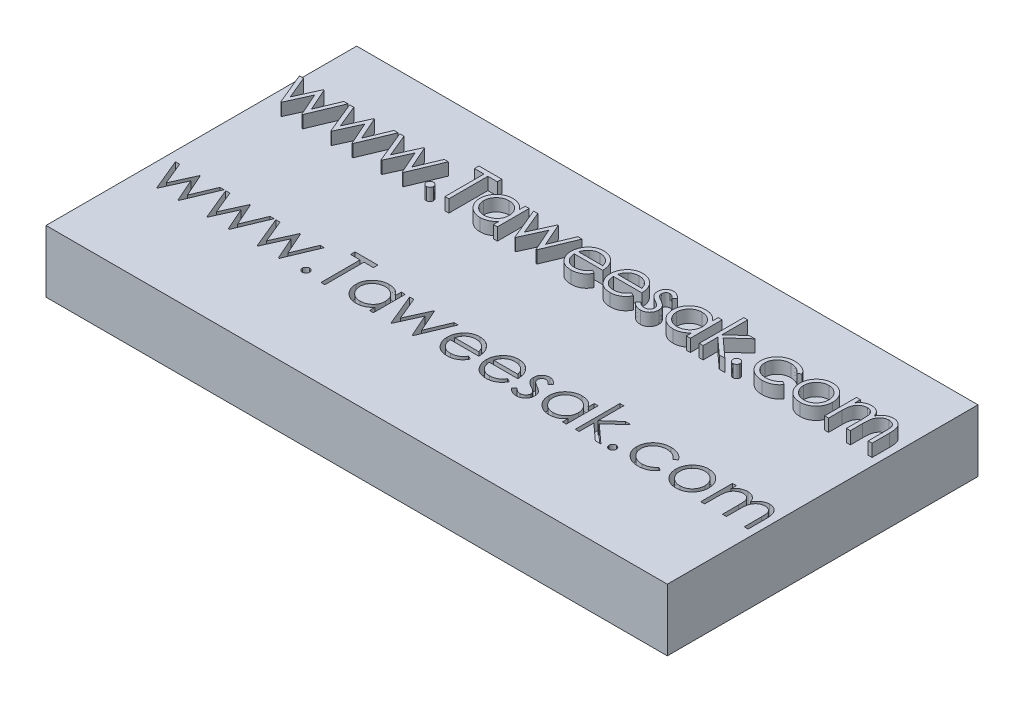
from build123d import *

# Parameters (mm, degrees)
SKETCH1_W          = 100
SKETCH1_H          = 50
EXTRUDE1_DEPTH     = 10
EXTRUDE2_DEPTH     = 2
CUT_EXTRUDE1_DEPTH = 2


with BuildPart() as part:
    # Sketch1 → Extrude1 (new body)
    with BuildSketch(Plane(origin=(0, 0, 0), x_dir=(1, 0, 0), z_dir=(0, 1, 0))):
        with Locations((50, 25)):
            Rectangle(SKETCH1_W, SKETCH1_H)
    extrude(amount=EXTRUDE1_DEPTH)

    # Sketch3 → Extrude2 (add)
    # profile 1 of 16: a face of its own
    with BuildSketch(Plane(origin=(0, 10, 0), x_dir=(-1, 0, 0), z_dir=(0, 1, 0))):
        Polygon((-1.538461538, -39.247257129), (-2.212940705, -39.247257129), (-3.737179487, -35.567769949), (-5.407251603, -39.247257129), (-5.513822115, -39.247257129), (-7.147435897, -35.567769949), (-8.685697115, -39.247257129), (-9.346153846, -39.247257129), (-7.207732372, -34.131872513), (-7.077323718, -34.131872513), (-5.442307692, -37.811359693), (-3.773637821, -34.131872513), (-3.657251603, -34.131872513), align=None)
    # profile 2 of 16: a face of its own
    with BuildSketch(Plane(origin=(0, 10, 0), x_dir=(-1, 0, 0), z_dir=(0, 1, 0))):
        Polygon((-9.615384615, -39.247257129), (-10.289863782, -39.247257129), (-11.814102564, -35.567769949), (-13.484174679, -39.247257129), (-13.590745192, -39.247257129), (-15.224358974, -35.567769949), (-16.762620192, -39.247257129), (-17.423076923, -39.247257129), (-15.284655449, -34.131872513), (-15.154246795, -34.131872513), (-13.519230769, -37.811359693), (-11.850560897, -34.131872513), (-11.734174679, -34.131872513), align=None)
    # profile 3 of 16: a face of its own
    with BuildSketch(Plane(origin=(0, 10, 0), x_dir=(-1, 0, 0), z_dir=(0, 1, 0))):
        Polygon((-17.692307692, -39.247257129), (-18.366786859, -39.247257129), (-19.891025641, -35.567769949), (-21.561097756, -39.247257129), (-21.667668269, -39.247257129), (-23.301282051, -35.567769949), (-24.839543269, -39.247257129), (-25.5, -39.247257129), (-23.361578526, -34.131872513), (-23.231169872, -34.131872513), (-21.596153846, -37.811359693), (-19.927483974, -34.131872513), (-19.811097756, -34.131872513), align=None)
    # profile 4 of 16: a face of its own
    with BuildSketch(Plane(origin=(0, 10, 0), x_dir=(-1, 0, 0), z_dir=(0, 1, 0))):
        with BuildLine():
            add(Edge.make_bspline(
                [(-27.16025641, -35.20879559), (-27.199263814, -35.2065558), (-27.275283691, -35.202190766), (-27.385362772, -35.170109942), (-27.485955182, -35.115980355), (-27.575003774, -35.04160575), (-27.649014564, -34.95281259), (-27.703766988, -34.852475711), (-27.737318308, -34.742077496), (-27.741465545, -34.664961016), (-27.743589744, -34.625462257)],
                knots=[0, 0, 0, 0, 1.020591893, 1.988988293, 2.974634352, 3.991697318, 5.008760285, 5.983632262, 6.967224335, 8, 8, 8, 8], degree=3))
            add(Edge.make_bspline(
                [(-27.743589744, -34.625462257), (-27.741388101, -34.586906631), (-27.737038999, -34.51074425), (-27.703751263, -34.401277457), (-27.649083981, -34.300826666), (-27.574535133, -34.212243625), (-27.486493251, -34.136079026), (-27.38504388, -34.08270049), (-27.275567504, -34.048268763), (-27.199314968, -34.044208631), (-27.16025641, -34.042128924)],
                knots=[0, 0, 0, 0, 1.010056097, 1.99525427, 2.971718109, 3.990441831, 5.01702829, 6.004283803, 6.977741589, 8, 8, 8, 8], degree=3))
            add(Edge.make_bspline(
                [(-27.16025641, -34.042128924), (-27.121225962, -34.044286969), (-27.044580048, -34.048524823), (-26.934693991, -34.082015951), (-26.833859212, -34.136599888), (-26.745794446, -34.21210617), (-26.671844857, -34.301287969), (-26.614639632, -34.400593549), (-26.584007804, -34.511060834), (-26.579306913, -34.58696899), (-26.576923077, -34.625462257)],
                knots=[0, 0, 0, 0, 1.021821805, 2.006599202, 2.982645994, 4.008793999, 5.027082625, 6.009034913, 6.990375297, 8, 8, 8, 8], degree=3))
            add(Edge.make_bspline(
                [(-26.576923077, -34.625462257), (-26.579235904, -34.664896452), (-26.583743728, -34.741755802), (-26.614625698, -34.853158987), (-26.671914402, -34.952350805), (-26.745327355, -35.041742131), (-26.834391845, -35.115467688), (-26.934381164, -35.170785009), (-27.044859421, -35.201938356), (-27.121275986, -35.206479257), (-27.16025641, -35.20879559)],
                knots=[0, 0, 0, 0, 1.032329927, 2.012066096, 2.992413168, 4.009037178, 5.025661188, 6.000112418, 6.979848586, 8, 8, 8, 8], degree=3))
        make_face()
    # profile 5 of 16: a face of its own
    with BuildSketch(Plane(origin=(0, 10, 0), x_dir=(-1, 0, 0), z_dir=(0, 1, 0))):
        Polygon((-28.551282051, -40.413923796), (-28.551282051, -41.131872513), (-32.230769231, -41.131872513), (-32.230769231, -40.413923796), (-30.705128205, -40.413923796), (-30.705128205, -34.131872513), (-30.076923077, -34.131872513), (-30.076923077, -40.413923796), align=None)
    # profile 6 of 16: a face of its own
    with BuildSketch(Plane(origin=(0, 10, 0), x_dir=(-1, 0, 0), z_dir=(0, 1, 0))):
        with BuildLine():
            Line((-38.512820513, -39.247257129), (-38.512820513, -34.131872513))
            Line((-38.512820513, -34.131872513), (-37.884615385, -34.131872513))
            Line((-37.884615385, -34.131872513), (-37.884615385, -35.016688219))
            add(Edge.make_bspline(
                [(-37.884615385, -35.016688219), (-37.813681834, -34.936719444), (-37.675048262, -34.780427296), (-37.445722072, -34.574984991), (-37.200628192, -34.407251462), (-36.943942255, -34.271101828), (-36.673677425, -34.168469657), (-36.391420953, -34.096166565), (-36.097393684, -34.049132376), (-35.896883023, -34.044484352), (-35.795272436, -34.042128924)],
                knots=[0, 0, 0, 0, 1.074235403, 2.099501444, 3.086304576, 4.053325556, 5.01427503, 5.985443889, 6.979105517, 8, 8, 8, 8], degree=3))
            add(Edge.make_bspline(
                [(-35.795272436, -34.042128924), (-35.704936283, -34.044581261), (-35.526789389, -34.049417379), (-35.264734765, -34.086947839), (-35.012537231, -34.147187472), (-34.770036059, -34.231068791), (-34.538874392, -34.341760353), (-34.317749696, -34.475712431), (-34.106145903, -34.633665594), (-33.908087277, -34.814942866), (-33.725472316, -35.011627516), (-33.565702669, -35.222020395), (-33.430292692, -35.443231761), (-33.319009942, -35.675199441), (-33.232893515, -35.917753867), (-33.172979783, -36.170728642), (-33.135489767, -36.433702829), (-33.130656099, -36.612782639), (-33.128205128, -36.703587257)],
                knots=[0, 0, 0, 0, 1.034036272, 2.039165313, 3.024406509, 3.999331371, 4.971254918, 5.953351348, 6.95522652, 7.989525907, 9.023492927, 10.024309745, 11.009187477, 11.988246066, 12.964946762, 13.950187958, 14.960617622, 16, 16, 16, 16], degree=3))
            add(Edge.make_bspline(
                [(-33.128205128, -36.703587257), (-33.130710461, -36.792515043), (-33.135663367, -36.968320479), (-33.172578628, -37.226872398), (-33.23460808, -37.475929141), (-33.321824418, -37.714568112), (-33.433166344, -37.943750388), (-33.570905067, -38.161682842), (-33.73061714, -38.371699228), (-33.915183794, -38.567064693), (-34.115020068, -38.74687124), (-34.327807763, -38.90520826), (-34.550893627, -39.038816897), (-34.78472498, -39.147427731), (-35.027646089, -39.23373651), (-35.281502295, -39.29390204), (-35.545139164, -39.32926974), (-35.724118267, -39.334398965), (-35.814903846, -39.337000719)],
                knots=[0, 0, 0, 0, 1.02050356, 2.017480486, 2.990790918, 3.96161403, 4.928589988, 5.909588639, 6.91611943, 7.952353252, 8.989586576, 9.99823133, 10.991940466, 11.968822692, 12.952985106, 13.945868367, 14.958059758, 16, 16, 16, 16], degree=3))
            add(Edge.make_bspline(
                [(-35.814903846, -39.337000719), (-35.919305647, -39.334136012), (-36.124032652, -39.328518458), (-36.42390547, -39.281370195), (-36.70771921, -39.202454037), (-36.977932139, -39.094741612), (-37.230746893, -38.949691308), (-37.468593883, -38.77021538), (-37.688650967, -38.551962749), (-37.818163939, -38.38593131), (-37.884615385, -38.300742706)],
                knots=[0, 0, 0, 0, 1.038908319, 2.037250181, 3.012632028, 3.966567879, 4.9252131, 5.905168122, 6.925168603, 8, 8, 8, 8], degree=3))
            Line((-37.884615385, -38.300742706), (-37.884615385, -39.247257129))
            Line((-37.884615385, -39.247257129), (-38.512820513, -39.247257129))
        make_face()
        with BuildLine():
            add(Edge.make_bspline(
                [(-35.823317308, -38.70879559), (-35.731490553, -38.705525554), (-35.550239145, -38.699071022), (-35.28412336, -38.64876396), (-35.029600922, -38.564844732), (-34.787085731, -38.450736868), (-34.563273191, -38.304568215), (-34.359929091, -38.132224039), (-34.18256574, -37.931592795), (-34.032600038, -37.707284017), (-33.908100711, -37.468255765), (-33.822186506, -37.216566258), (-33.765121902, -36.959018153), (-33.759321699, -36.784284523), (-33.756410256, -36.696576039)],
                knots=[0, 0, 0, 0, 1.031179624, 2.035384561, 3.030098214, 4.035455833, 5.037557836, 6.024646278, 7.02156144, 8.035264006, 9.049836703, 10.039645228, 11.015989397, 12, 12, 12, 12], degree=3))
            add(Edge.make_bspline(
                [(-33.756410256, -36.696576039), (-33.760189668, -36.609413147), (-33.767733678, -36.435429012), (-33.820433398, -36.177486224), (-33.91293668, -35.927438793), (-34.034712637, -35.685329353), (-34.187038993, -35.459347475), (-34.364052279, -35.255011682), (-34.568428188, -35.080010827), (-34.794211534, -34.933429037), (-35.035104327, -34.815515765), (-35.288521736, -34.732351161), (-35.550046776, -34.679841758), (-35.728187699, -34.673513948), (-35.817708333, -34.670334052)],
                knots=[0, 0, 0, 0, 0.979235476, 1.954632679, 2.943119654, 3.967171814, 4.992637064, 5.997548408, 6.995574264, 8.005058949, 9.015076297, 9.999929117, 10.994910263, 12, 12, 12, 12], degree=3))
            add(Edge.make_bspline(
                [(-35.817708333, -34.670334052), (-35.908599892, -34.673642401), (-36.088914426, -34.680205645), (-36.355950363, -34.73085965), (-36.61461513, -34.815820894), (-36.862802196, -34.931513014), (-37.093616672, -35.074943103), (-37.299812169, -35.24360406), (-37.477945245, -35.436752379), (-37.624608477, -35.65323395), (-37.741790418, -35.887944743), (-37.824764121, -36.13863866), (-37.875159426, -36.403825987), (-37.881419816, -36.585574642), (-37.884615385, -36.678346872)],
                knots=[0, 0, 0, 0, 1.017730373, 2.019016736, 3.032373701, 4.060729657, 5.079187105, 6.068726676, 7.03591854, 8.011858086, 8.988317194, 9.965225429, 10.961364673, 12, 12, 12, 12], degree=3))
            add(Edge.make_bspline(
                [(-37.884615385, -36.678346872), (-37.882696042, -36.749022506), (-37.878918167, -36.888134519), (-37.850057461, -37.092389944), (-37.804146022, -37.287855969), (-37.739459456, -37.47474654), (-37.654455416, -37.651997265), (-37.552040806, -37.820997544), (-37.43011495, -37.980173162), (-37.292388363, -38.129322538), (-37.139934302, -38.264681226), (-36.977819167, -38.383985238), (-36.806450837, -38.48494926), (-36.625949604, -38.565746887), (-36.437705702, -38.631570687), (-36.239914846, -38.67504617), (-36.034570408, -38.704994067), (-35.894476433, -38.707515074), (-35.823317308, -38.70879559)],
                knots=[0, 0, 0, 0, 1.050062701, 2.066855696, 3.059271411, 4.030305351, 4.999747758, 5.975466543, 6.961907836, 7.974539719, 8.98812422, 9.98710676, 10.961662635, 11.93785114, 12.922015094, 13.919620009, 14.94329489, 16, 16, 16, 16], degree=3))
        make_face(mode=Mode.SUBTRACT)
    # profile 7 of 16: a face of its own
    with BuildSketch(Plane(origin=(0, 10, 0), x_dir=(-1, 0, 0), z_dir=(0, 1, 0))):
        Polygon((-39.230769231, -39.247257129), (-39.905248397, -39.247257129), (-41.429487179, -35.567769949), (-43.099559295, -39.247257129), (-43.206129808, -39.247257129), (-44.83974359, -35.567769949), (-46.378004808, -39.247257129), (-47.038461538, -39.247257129), (-44.900040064, -34.131872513), (-44.76963141, -34.131872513), (-43.134615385, -37.811359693), (-41.465945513, -34.131872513), (-41.349559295, -34.131872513), align=None)
    # profile 8 of 16: a face of its own
    with BuildSketch(Plane(origin=(0, 10, 0), x_dir=(-1, 0, 0), z_dir=(0, 1, 0))):
        with BuildLine():
            Line((-52.223958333, -35.747257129), (-52.782051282, -35.454188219))
            add(Edge.make_bspline(
                [(-52.782051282, -35.454188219), (-52.737548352, -35.375326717), (-52.650963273, -35.221893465), (-52.502777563, -35.010976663), (-52.345825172, -34.823012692), (-52.176987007, -34.65888395), (-51.998381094, -34.514734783), (-51.807347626, -34.391220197), (-51.607065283, -34.283980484), (-51.394629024, -34.196574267), (-51.170241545, -34.127776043), (-50.932520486, -34.076990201), (-50.680365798, -34.047533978), (-50.507689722, -34.043959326), (-50.419270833, -34.042128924)],
                knots=[0, 0, 0, 0, 1.120547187, 2.180141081, 3.186367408, 4.148075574, 5.090720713, 6.023293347, 6.960451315, 7.899733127, 8.862572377, 9.862522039, 10.90550313, 12, 12, 12, 12], degree=3))
            add(Edge.make_bspline(
                [(-50.419270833, -34.042128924), (-50.320986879, -34.044423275), (-50.129263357, -34.048898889), (-49.850183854, -34.087483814), (-49.587425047, -34.150428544), (-49.341001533, -34.238359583), (-49.111517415, -34.353214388), (-48.898514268, -34.49313277), (-48.700880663, -34.657399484), (-48.524811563, -34.847424), (-48.366400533, -35.050818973), (-48.226271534, -35.262618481), (-48.110476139, -35.482733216), (-48.011640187, -35.707821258), (-47.938510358, -35.940878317), (-47.883912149, -36.179851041), (-47.853320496, -36.42561455), (-47.848555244, -36.591796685), (-47.846153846, -36.675542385)],
                knots=[0, 0, 0, 0, 1.145213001, 2.233978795, 3.276616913, 4.289988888, 5.2768102, 6.260573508, 7.254647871, 8.264498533, 9.273731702, 10.25749501, 11.220258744, 12.169609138, 13.119022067, 14.062790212, 15.023763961, 16, 16, 16, 16], degree=3))
            add(Edge.make_bspline(
                [(-47.846153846, -36.675542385), (-47.848272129, -36.754132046), (-47.852470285, -36.909886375), (-47.87893186, -37.140417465), (-47.925828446, -37.36447437), (-47.990181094, -37.582243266), (-48.073283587, -37.793359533), (-48.174948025, -37.997951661), (-48.295332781, -38.19580194), (-48.388278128, -38.320608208), (-48.435096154, -38.383475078)],
                knots=[0, 0, 0, 0, 1.024358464, 2.0301432, 3.019427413, 4.004406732, 4.986367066, 5.972626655, 6.978780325, 8, 8, 8, 8], degree=3))
            add(Edge.make_bspline(
                [(-48.435096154, -38.383475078), (-48.498402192, -38.459338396), (-48.622805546, -38.608418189), (-48.835399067, -38.802517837), (-49.062498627, -38.968553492), (-49.306388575, -39.104005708), (-49.566658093, -39.208189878), (-49.84196473, -39.282294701), (-50.133069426, -39.328406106), (-50.33262488, -39.334092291), (-50.434695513, -39.337000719)],
                knots=[0, 0, 0, 0, 1.030811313, 2.025658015, 2.997072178, 3.962767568, 4.930766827, 5.917075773, 6.934604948, 8, 8, 8, 8], degree=3))
            add(Edge.make_bspline(
                [(-50.434695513, -39.337000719), (-50.539596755, -39.334306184), (-50.745389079, -39.329020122), (-51.045368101, -39.279575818), (-51.329771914, -39.202118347), (-51.596253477, -39.089266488), (-51.84891888, -38.9493789), (-52.081953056, -38.77256754), (-52.301752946, -38.567913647), (-52.429556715, -38.410362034), (-52.494591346, -38.330189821)],
                knots=[0, 0, 0, 0, 1.056389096, 2.072394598, 3.055233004, 4.020130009, 4.981825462, 5.957811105, 6.960805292, 8, 8, 8, 8], degree=3))
            add(Edge.make_bspline(
                [(-52.494591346, -38.330189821), (-52.538845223, -38.269782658), (-52.627058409, -38.149370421), (-52.737552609, -37.953028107), (-52.833467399, -37.747606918), (-52.910133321, -37.529786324), (-52.972212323, -37.302147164), (-53.017125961, -37.063062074), (-53.043465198, -36.812602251), (-53.048642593, -36.64194914), (-53.051282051, -36.554949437)],
                knots=[0, 0, 0, 0, 0.94817472, 1.890038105, 2.849395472, 3.817997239, 4.812318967, 5.836947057, 6.897266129, 8, 8, 8, 8], degree=3))
            Line((-53.051282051, -36.554949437), (-48.474358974, -36.554949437))
            add(Edge.make_bspline(
                [(-48.474358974, -36.554949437), (-48.477441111, -36.487549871), (-48.483502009, -36.355011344), (-48.511690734, -36.161050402), (-48.556338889, -35.976373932), (-48.618401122, -35.801768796), (-48.696220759, -35.636661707), (-48.788551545, -35.479914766), (-48.899377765, -35.333908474), (-49.022786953, -35.196750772), (-49.160219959, -35.074651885), (-49.304753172, -34.965283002), (-49.458283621, -34.874123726), (-49.619263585, -34.799015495), (-49.788527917, -34.741207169), (-49.965838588, -34.701398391), (-50.150644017, -34.674804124), (-50.276614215, -34.671842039), (-50.340745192, -34.670334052)],
                knots=[0, 0, 0, 0, 1.094405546, 2.152104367, 3.174987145, 4.173015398, 5.153654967, 6.133208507, 7.119289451, 8.123438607, 9.122504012, 10.097966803, 11.060604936, 12.014205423, 12.976096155, 13.956823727, 14.959826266, 16, 16, 16, 16], degree=3))
            add(Edge.make_bspline(
                [(-50.340745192, -34.670334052), (-50.403451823, -34.671531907), (-50.527873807, -34.673908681), (-50.713546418, -34.69769973), (-50.896638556, -34.73478047), (-51.07477607, -34.7885844), (-51.245106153, -34.852215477), (-51.404170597, -34.92661515), (-51.550475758, -35.01047284), (-51.686956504, -35.107252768), (-51.818617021, -35.224795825), (-51.94964223, -35.371754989), (-52.088875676, -35.546599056), (-52.177236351, -35.67785412), (-52.223958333, -35.747257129)],
                knots=[0, 0, 0, 0, 0.991026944, 1.966387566, 2.954903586, 3.941705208, 4.905318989, 5.827751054, 6.715113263, 7.568237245, 8.468614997, 9.499196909, 10.677664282, 12, 12, 12, 12], degree=3))
        make_face()
        with BuildLine():
            add(Edge.make_bspline(
                [(-52.423076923, -37.183154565), (-52.40021586, -37.266541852), (-52.356330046, -37.426618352), (-52.26227715, -37.647689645), (-52.161265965, -37.846425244), (-52.037221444, -38.017799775), (-51.896840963, -38.169192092), (-51.734190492, -38.300695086), (-51.554643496, -38.421317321), (-51.354935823, -38.521871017), (-51.142786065, -38.604472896), (-50.922598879, -38.665218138), (-50.696206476, -38.700924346), (-50.543726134, -38.706159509), (-50.466947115, -38.70879559)],
                knots=[0, 0, 0, 0, 1.154958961, 2.217145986, 3.207012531, 4.129872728, 5.036522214, 5.960144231, 6.920619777, 7.92424629, 8.943461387, 9.961007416, 10.973298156, 12, 12, 12, 12], degree=3))
            add(Edge.make_bspline(
                [(-50.466947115, -38.70879559), (-50.404245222, -38.707581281), (-50.280296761, -38.705180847), (-50.097738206, -38.682110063), (-49.921645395, -38.644546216), (-49.752862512, -38.590800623), (-49.59100831, -38.523218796), (-49.43534018, -38.441884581), (-49.287731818, -38.342921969), (-49.195455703, -38.267387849), (-49.148838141, -38.229228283)],
                knots=[0, 0, 0, 0, 1.04879286, 2.073242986, 3.073461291, 4.057960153, 5.032623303, 6.005244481, 6.992256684, 8, 8, 8, 8], degree=3))
            add(Edge.make_bspline(
                [(-49.148838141, -38.229228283), (-49.115446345, -38.199042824), (-49.047869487, -38.137954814), (-48.957670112, -38.032646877), (-48.870663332, -37.919025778), (-48.79334513, -37.792131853), (-48.719865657, -37.655644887), (-48.652906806, -37.508568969), (-48.592024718, -37.350283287), (-48.557847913, -37.239929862), (-48.540264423, -37.183154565)],
                knots=[0, 0, 0, 0, 0.879905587, 1.780714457, 2.708106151, 3.677566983, 4.684151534, 5.740052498, 6.837288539, 8, 8, 8, 8], degree=3))
            Line((-48.540264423, -37.183154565), (-52.423076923, -37.183154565))
        make_face(mode=Mode.SUBTRACT)
    # profile 9 of 16: a face of its own
    with BuildSketch(Plane(origin=(0, 10, 0), x_dir=(-1, 0, 0), z_dir=(0, 1, 0))):
        with BuildLine():
            Line((-58.506009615, -35.747257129), (-59.064102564, -35.454188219))
            add(Edge.make_bspline(
                [(-59.064102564, -35.454188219), (-59.019599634, -35.375326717), (-58.933014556, -35.221893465), (-58.784828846, -35.010976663), (-58.627876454, -34.823012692), (-58.459038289, -34.65888395), (-58.280432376, -34.514734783), (-58.089398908, -34.391220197), (-57.889116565, -34.283980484), (-57.676680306, -34.196574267), (-57.452292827, -34.127776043), (-57.214571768, -34.076990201), (-56.96241708, -34.047533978), (-56.789741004, -34.043959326), (-56.701322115, -34.042128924)],
                knots=[0, 0, 0, 0, 1.120547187, 2.180141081, 3.186367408, 4.148075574, 5.090720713, 6.023293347, 6.960451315, 7.899733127, 8.862572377, 9.862522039, 10.90550313, 12, 12, 12, 12], degree=3))
            add(Edge.make_bspline(
                [(-56.701322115, -34.042128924), (-56.603038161, -34.044423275), (-56.411314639, -34.048898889), (-56.132235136, -34.087483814), (-55.869476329, -34.150428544), (-55.623052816, -34.238359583), (-55.393568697, -34.353214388), (-55.18056555, -34.49313277), (-54.982931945, -34.657399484), (-54.806862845, -34.847424), (-54.648451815, -35.050818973), (-54.508322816, -35.262618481), (-54.392527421, -35.482733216), (-54.293691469, -35.707821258), (-54.22056164, -35.940878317), (-54.165963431, -36.179851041), (-54.135371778, -36.42561455), (-54.130606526, -36.591796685), (-54.128205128, -36.675542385)],
                knots=[0, 0, 0, 0, 1.145213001, 2.233978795, 3.276616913, 4.289988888, 5.2768102, 6.260573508, 7.254647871, 8.264498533, 9.273731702, 10.25749501, 11.220258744, 12.169609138, 13.119022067, 14.062790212, 15.023763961, 16, 16, 16, 16], degree=3))
            add(Edge.make_bspline(
                [(-54.128205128, -36.675542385), (-54.130323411, -36.754132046), (-54.134521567, -36.909886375), (-54.160983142, -37.140417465), (-54.207879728, -37.36447437), (-54.272232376, -37.582243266), (-54.355334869, -37.793359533), (-54.456999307, -37.997951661), (-54.577384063, -38.19580194), (-54.67032941, -38.320608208), (-54.717147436, -38.383475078)],
                knots=[0, 0, 0, 0, 1.024358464, 2.0301432, 3.019427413, 4.004406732, 4.986367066, 5.972626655, 6.978780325, 8, 8, 8, 8], degree=3))
            add(Edge.make_bspline(
                [(-54.717147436, -38.383475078), (-54.780453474, -38.459338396), (-54.904856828, -38.608418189), (-55.117450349, -38.802517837), (-55.344549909, -38.968553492), (-55.588439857, -39.104005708), (-55.848709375, -39.208189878), (-56.124016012, -39.282294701), (-56.415120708, -39.328406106), (-56.614676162, -39.334092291), (-56.716746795, -39.337000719)],
                knots=[0, 0, 0, 0, 1.030811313, 2.025658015, 2.997072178, 3.962767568, 4.930766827, 5.917075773, 6.934604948, 8, 8, 8, 8], degree=3))
            add(Edge.make_bspline(
                [(-56.716746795, -39.337000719), (-56.821648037, -39.334306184), (-57.027440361, -39.329020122), (-57.327419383, -39.279575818), (-57.611823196, -39.202118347), (-57.878304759, -39.089266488), (-58.130970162, -38.9493789), (-58.364004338, -38.77256754), (-58.583804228, -38.567913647), (-58.711607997, -38.410362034), (-58.776642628, -38.330189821)],
                knots=[0, 0, 0, 0, 1.056389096, 2.072394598, 3.055233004, 4.020130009, 4.981825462, 5.957811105, 6.960805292, 8, 8, 8, 8], degree=3))
            add(Edge.make_bspline(
                [(-58.776642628, -38.330189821), (-58.820896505, -38.269782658), (-58.909109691, -38.149370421), (-59.019603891, -37.953028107), (-59.115518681, -37.747606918), (-59.192184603, -37.529786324), (-59.254263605, -37.302147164), (-59.299177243, -37.063062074), (-59.32551648, -36.812602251), (-59.330693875, -36.64194914), (-59.333333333, -36.554949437)],
                knots=[0, 0, 0, 0, 0.94817472, 1.890038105, 2.849395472, 3.817997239, 4.812318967, 5.836947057, 6.897266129, 8, 8, 8, 8], degree=3))
            Line((-59.333333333, -36.554949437), (-54.756410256, -36.554949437))
            add(Edge.make_bspline(
                [(-54.756410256, -36.554949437), (-54.759492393, -36.487549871), (-54.765553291, -36.355011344), (-54.793742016, -36.161050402), (-54.838390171, -35.976373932), (-54.900452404, -35.801768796), (-54.978272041, -35.636661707), (-55.070602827, -35.479914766), (-55.181429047, -35.333908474), (-55.304838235, -35.196750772), (-55.442271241, -35.074651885), (-55.586804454, -34.965283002), (-55.740334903, -34.874123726), (-55.901314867, -34.799015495), (-56.070579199, -34.741207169), (-56.24788987, -34.701398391), (-56.432695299, -34.674804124), (-56.558665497, -34.671842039), (-56.622796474, -34.670334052)],
                knots=[0, 0, 0, 0, 1.094405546, 2.152104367, 3.174987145, 4.173015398, 5.153654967, 6.133208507, 7.119289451, 8.123438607, 9.122504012, 10.097966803, 11.060604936, 12.014205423, 12.976096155, 13.956823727, 14.959826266, 16, 16, 16, 16], degree=3))
            add(Edge.make_bspline(
                [(-56.622796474, -34.670334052), (-56.685503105, -34.671531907), (-56.809925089, -34.673908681), (-56.9955977, -34.69769973), (-57.178689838, -34.73478047), (-57.356827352, -34.7885844), (-57.527157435, -34.852215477), (-57.686221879, -34.92661515), (-57.83252704, -35.01047284), (-57.969007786, -35.107252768), (-58.100668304, -35.224795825), (-58.231693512, -35.371754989), (-58.370926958, -35.546599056), (-58.459287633, -35.67785412), (-58.506009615, -35.747257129)],
                knots=[0, 0, 0, 0, 0.991026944, 1.966387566, 2.954903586, 3.941705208, 4.905318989, 5.827751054, 6.715113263, 7.568237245, 8.468614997, 9.499196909, 10.677664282, 12, 12, 12, 12], degree=3))
        make_face()
        with BuildLine():
            add(Edge.make_bspline(
                [(-58.705128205, -37.183154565), (-58.682267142, -37.266541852), (-58.638381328, -37.426618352), (-58.544328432, -37.647689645), (-58.443317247, -37.846425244), (-58.319272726, -38.017799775), (-58.178892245, -38.169192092), (-58.016241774, -38.300695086), (-57.836694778, -38.421317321), (-57.636987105, -38.521871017), (-57.424837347, -38.604472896), (-57.204650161, -38.665218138), (-56.978257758, -38.700924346), (-56.825777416, -38.706159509), (-56.748998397, -38.70879559)],
                knots=[0, 0, 0, 0, 1.154958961, 2.217145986, 3.207012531, 4.129872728, 5.036522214, 5.960144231, 6.920619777, 7.92424629, 8.943461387, 9.961007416, 10.973298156, 12, 12, 12, 12], degree=3))
            add(Edge.make_bspline(
                [(-56.748998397, -38.70879559), (-56.686296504, -38.707581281), (-56.562348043, -38.705180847), (-56.379789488, -38.682110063), (-56.203696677, -38.644546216), (-56.034913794, -38.590800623), (-55.873059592, -38.523218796), (-55.717391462, -38.441884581), (-55.5697831, -38.342921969), (-55.477506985, -38.267387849), (-55.430889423, -38.229228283)],
                knots=[0, 0, 0, 0, 1.04879286, 2.073242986, 3.073461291, 4.057960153, 5.032623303, 6.005244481, 6.992256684, 8, 8, 8, 8], degree=3))
            add(Edge.make_bspline(
                [(-55.430889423, -38.229228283), (-55.397497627, -38.199042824), (-55.329920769, -38.137954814), (-55.239721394, -38.032646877), (-55.152714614, -37.919025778), (-55.075396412, -37.792131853), (-55.001916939, -37.655644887), (-54.934958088, -37.508568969), (-54.874076, -37.350283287), (-54.839899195, -37.239929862), (-54.822315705, -37.183154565)],
                knots=[0, 0, 0, 0, 0.879905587, 1.780714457, 2.708106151, 3.677566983, 4.684151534, 5.740052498, 6.837288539, 8, 8, 8, 8], degree=3))
            Line((-54.822315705, -37.183154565), (-58.705128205, -37.183154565))
        make_face(mode=Mode.SUBTRACT)
    # profile 10 of 16: a face of its own
    with BuildSketch(Plane(origin=(0, 10, 0), x_dir=(-1, 0, 0), z_dir=(0, 1, 0))):
        with BuildLine():
            Line((-63.012820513, -38.609236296), (-62.586538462, -38.170334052))
            add(Edge.make_bspline(
                [(-62.586538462, -38.170334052), (-62.549763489, -38.21296956), (-62.478865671, -38.295165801), (-62.366322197, -38.404916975), (-62.254250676, -38.49785304), (-62.143242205, -38.574323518), (-62.033089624, -38.63450649), (-61.922852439, -38.67701309), (-61.812833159, -38.703698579), (-61.739255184, -38.707116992), (-61.703125, -38.70879559)],
                knots=[0, 0, 0, 0, 1.265880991, 2.440469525, 3.530740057, 4.536711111, 5.468008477, 6.34654737, 7.188078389, 8, 8, 8, 8], degree=3))
            add(Edge.make_bspline(
                [(-61.703125, -38.70879559), (-61.658863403, -38.706619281), (-61.571762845, -38.702336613), (-61.447051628, -38.660624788), (-61.332691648, -38.594775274), (-61.231485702, -38.504991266), (-61.146986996, -38.398593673), (-61.083653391, -38.280629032), (-61.04575439, -38.152989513), (-61.040915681, -38.064947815), (-61.038461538, -38.020293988)],
                knots=[0, 0, 0, 0, 0.999905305, 1.967672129, 2.944835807, 3.972828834, 5.013019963, 6.007753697, 6.989553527, 8, 8, 8, 8], degree=3))
            add(Edge.make_bspline(
                [(-61.038461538, -38.020293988), (-61.040683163, -37.9798699), (-61.045120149, -37.899135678), (-61.079613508, -37.78003961), (-61.134545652, -37.663925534), (-61.185886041, -37.592799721), (-61.212339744, -37.55615136)],
                knots=[0, 0, 0, 0, 0.960159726, 1.917612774, 2.927026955, 4, 4, 4, 4], degree=3))
            add(Edge.make_bspline(
                [(-61.212339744, -37.55615136), (-61.228348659, -37.536668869), (-61.262627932, -37.494951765), (-61.324804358, -37.435582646), (-61.39845865, -37.373504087), (-61.484290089, -37.309137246), (-61.582471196, -37.242414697), (-61.691563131, -37.172203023), (-61.812914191, -37.100557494), (-61.89837648, -37.0534528), (-61.942908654, -37.02890777)],
                knots=[0, 0, 0, 0, 0.667332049, 1.428932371, 2.272176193, 3.217953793, 4.268659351, 5.415594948, 6.6533338, 8, 8, 8, 8], degree=3))
            add(Edge.make_bspline(
                [(-61.942908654, -37.02890777), (-61.997345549, -36.998430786), (-62.102499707, -36.939559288), (-62.251754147, -36.847967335), (-62.388010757, -36.757543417), (-62.509388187, -36.666220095), (-62.618732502, -36.577753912), (-62.714286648, -36.489699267), (-62.796346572, -36.401823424), (-62.84224437, -36.340344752), (-62.864182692, -36.310959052)],
                knots=[0, 0, 0, 0, 1.271974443, 2.457035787, 3.569878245, 4.604907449, 5.553098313, 6.436573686, 7.252710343, 8, 8, 8, 8], degree=3))
            add(Edge.make_bspline(
                [(-62.864182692, -36.310959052), (-62.900840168, -36.251710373), (-62.97393568, -36.133567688), (-63.046439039, -35.937940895), (-63.09409632, -35.732720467), (-63.099704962, -35.591886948), (-63.102564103, -35.520093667)],
                knots=[0, 0, 0, 0, 0.995678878, 1.985397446, 2.973007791, 4, 4, 4, 4], degree=3))
            add(Edge.make_bspline(
                [(-63.102564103, -35.520093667), (-63.101128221, -35.469553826), (-63.09829866, -35.369959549), (-63.0785368, -35.223312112), (-63.044794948, -35.082961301), (-62.998057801, -34.948058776), (-62.938011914, -34.818967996), (-62.86316164, -34.696603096), (-62.774845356, -34.580988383), (-62.676502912, -34.470607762), (-62.566674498, -34.370315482), (-62.448108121, -34.283469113), (-62.324380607, -34.207914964), (-62.192772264, -34.147833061), (-62.054936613, -34.099547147), (-61.910088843, -34.066263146), (-61.758838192, -34.046306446), (-61.655977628, -34.043539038), (-61.603565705, -34.042128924)],
                knots=[0, 0, 0, 0, 1.032810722, 2.035266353, 3.017676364, 3.978389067, 4.948507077, 5.921677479, 6.903715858, 7.918386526, 8.939467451, 9.936812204, 10.918153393, 11.89693397, 12.887853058, 13.89815236, 14.929017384, 16, 16, 16, 16], degree=3))
            add(Edge.make_bspline(
                [(-61.603565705, -34.042128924), (-61.532827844, -34.044105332), (-61.392335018, -34.048030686), (-61.184607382, -34.085175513), (-60.981197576, -34.142306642), (-60.785028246, -34.223759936), (-60.599096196, -34.323899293), (-60.427972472, -34.442380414), (-60.273437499, -34.57857701), (-60.185162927, -34.682750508), (-60.141025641, -34.734837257)],
                knots=[0, 0, 0, 0, 1.014105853, 2.01412079, 3.018242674, 4.040740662, 5.055023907, 6.042888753, 7.021444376, 8, 8, 8, 8], degree=3))
            Line((-60.141025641, -34.734837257), (-60.557491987, -35.20879559))
            add(Edge.make_bspline(
                [(-60.557491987, -35.20879559), (-60.597036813, -35.166086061), (-60.673700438, -35.083287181), (-60.796302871, -34.9730385), (-60.921061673, -34.880635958), (-61.046731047, -34.803349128), (-61.175171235, -34.743798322), (-61.305662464, -34.701961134), (-61.437939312, -34.67507275), (-61.526783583, -34.671916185), (-61.571314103, -34.670334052)],
                knots=[0, 0, 0, 0, 1.179806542, 2.287233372, 3.337373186, 4.324005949, 5.273901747, 6.200048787, 7.097828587, 8, 8, 8, 8], degree=3))
            add(Edge.make_bspline(
                [(-61.571314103, -34.670334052), (-61.631949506, -34.673075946), (-61.750420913, -34.678433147), (-61.920114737, -34.727063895), (-62.076768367, -34.803336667), (-62.212905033, -34.911457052), (-62.328111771, -35.037247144), (-62.413214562, -35.178424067), (-62.464780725, -35.332464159), (-62.471137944, -35.43931342), (-62.474358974, -35.493451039)],
                knots=[0, 0, 0, 0, 1.072236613, 2.094970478, 3.102399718, 4.141104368, 5.155589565, 6.110053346, 7.042415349, 8, 8, 8, 8], degree=3))
            add(Edge.make_bspline(
                [(-62.474358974, -35.493451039), (-62.472253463, -35.538090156), (-62.468117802, -35.625770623), (-62.43361334, -35.75297884), (-62.381425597, -35.874336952), (-62.328638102, -35.945409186), (-62.301883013, -35.981431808)],
                knots=[0, 0, 0, 0, 1.014054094, 1.991812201, 2.982159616, 4, 4, 4, 4], degree=3))
            add(Edge.make_bspline(
                [(-62.301883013, -35.981431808), (-62.285841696, -35.999507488), (-62.250897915, -36.038882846), (-62.186719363, -36.095635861), (-62.110486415, -36.157198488), (-62.018813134, -36.219846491), (-61.916324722, -36.289248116), (-61.797547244, -36.358072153), (-61.667084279, -36.433134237), (-61.574722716, -36.482743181), (-61.526442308, -36.508675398)],
                knots=[0, 0, 0, 0, 0.615029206, 1.339755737, 2.178261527, 3.109653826, 4.166232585, 5.329982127, 6.604294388, 8, 8, 8, 8], degree=3))
            add(Edge.make_bspline(
                [(-61.526442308, -36.508675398), (-61.474349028, -36.537753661), (-61.373323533, -36.594145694), (-61.230228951, -36.681977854), (-61.101134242, -36.771312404), (-60.982933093, -36.857138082), (-60.878611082, -36.94397997), (-60.788579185, -37.031934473), (-60.709292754, -37.117454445), (-60.66539793, -37.178049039), (-60.64443109, -37.206992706)],
                knots=[0, 0, 0, 0, 1.262093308, 2.447601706, 3.550203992, 4.582594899, 5.537233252, 6.418365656, 7.244515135, 8, 8, 8, 8], degree=3))
            add(Edge.make_bspline(
                [(-60.64443109, -37.206992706), (-60.608222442, -37.265302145), (-60.536023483, -37.381569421), (-60.464675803, -37.575874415), (-60.416986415, -37.780986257), (-60.412528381, -37.922786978), (-60.41025641, -37.995053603)],
                knots=[0, 0, 0, 0, 0.984940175, 1.963941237, 2.962352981, 4, 4, 4, 4], degree=3))
            add(Edge.make_bspline(
                [(-60.41025641, -37.995053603), (-60.411323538, -38.042304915), (-60.41341206, -38.134782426), (-60.43011794, -38.270652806), (-60.460436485, -38.39977561), (-60.498907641, -38.524342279), (-60.551258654, -38.642062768), (-60.614726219, -38.754161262), (-60.690726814, -38.858821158), (-60.776244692, -38.95675995), (-60.869164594, -39.046704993), (-60.971032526, -39.123645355), (-61.077603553, -39.190370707), (-61.191208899, -39.243811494), (-61.310397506, -39.286282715), (-61.436097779, -39.315050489), (-61.567440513, -39.33440114), (-61.657245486, -39.336121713), (-61.703125, -39.337000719)],
                knots=[0, 0, 0, 0, 1.087410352, 2.12821612, 3.143409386, 4.13688077, 5.124334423, 6.102425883, 7.096654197, 8.095527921, 9.09231389, 10.067027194, 11.028349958, 11.981147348, 12.950860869, 13.934615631, 14.944837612, 16, 16, 16, 16], degree=3))
            add(Edge.make_bspline(
                [(-61.703125, -39.337000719), (-61.757511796, -39.334797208), (-61.867305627, -39.33034885), (-62.031973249, -39.294856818), (-62.196211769, -39.237057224), (-62.360189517, -39.155353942), (-62.524605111, -39.05259026), (-62.688721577, -38.926102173), (-62.855205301, -38.779460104), (-62.959108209, -38.667245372), (-63.012820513, -38.609236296)],
                knots=[0, 0, 0, 0, 0.845753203, 1.707371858, 2.609134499, 3.549244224, 4.552329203, 5.621587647, 6.770486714, 8, 8, 8, 8], degree=3))
        make_face()
    # profile 11 of 16: a face of its own
    with BuildSketch(Plane(origin=(0, 10, 0), x_dir=(-1, 0, 0), z_dir=(0, 1, 0))):
        with BuildLine():
            Line((-69.564102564, -39.247257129), (-69.564102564, -34.131872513))
            Line((-69.564102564, -34.131872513), (-68.935897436, -34.131872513))
            Line((-68.935897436, -34.131872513), (-68.935897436, -35.016688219))
            add(Edge.make_bspline(
                [(-68.935897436, -35.016688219), (-68.864963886, -34.936719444), (-68.726330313, -34.780427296), (-68.497004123, -34.574984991), (-68.251910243, -34.407251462), (-67.995224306, -34.271101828), (-67.724959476, -34.168469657), (-67.442703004, -34.096166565), (-67.148675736, -34.049132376), (-66.948165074, -34.044484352), (-66.846554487, -34.042128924)],
                knots=[0, 0, 0, 0, 1.074235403, 2.099501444, 3.086304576, 4.053325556, 5.01427503, 5.985443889, 6.979105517, 8, 8, 8, 8], degree=3))
            add(Edge.make_bspline(
                [(-66.846554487, -34.042128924), (-66.756218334, -34.044581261), (-66.57807144, -34.049417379), (-66.316016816, -34.086947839), (-66.063819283, -34.147187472), (-65.821318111, -34.231068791), (-65.590156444, -34.341760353), (-65.369031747, -34.475712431), (-65.157427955, -34.633665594), (-64.959369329, -34.814942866), (-64.776754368, -35.011627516), (-64.616984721, -35.222020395), (-64.481574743, -35.443231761), (-64.370291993, -35.675199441), (-64.284175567, -35.917753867), (-64.224261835, -36.170728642), (-64.186771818, -36.433702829), (-64.18193815, -36.612782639), (-64.179487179, -36.703587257)],
                knots=[0, 0, 0, 0, 1.034036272, 2.039165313, 3.024406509, 3.999331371, 4.971254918, 5.953351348, 6.95522652, 7.989525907, 9.023492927, 10.024309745, 11.009187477, 11.988246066, 12.964946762, 13.950187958, 14.960617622, 16, 16, 16, 16], degree=3))
            add(Edge.make_bspline(
                [(-64.179487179, -36.703587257), (-64.181992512, -36.792515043), (-64.186945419, -36.968320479), (-64.22386068, -37.226872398), (-64.285890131, -37.475929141), (-64.373106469, -37.714568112), (-64.484448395, -37.943750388), (-64.622187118, -38.161682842), (-64.781899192, -38.371699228), (-64.966465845, -38.567064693), (-65.16630212, -38.74687124), (-65.379089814, -38.90520826), (-65.602175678, -39.038816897), (-65.836007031, -39.147427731), (-66.07892814, -39.23373651), (-66.332784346, -39.29390204), (-66.596421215, -39.32926974), (-66.775400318, -39.334398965), (-66.866185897, -39.337000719)],
                knots=[0, 0, 0, 0, 1.02050356, 2.017480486, 2.990790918, 3.96161403, 4.928589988, 5.909588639, 6.91611943, 7.952353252, 8.989586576, 9.99823133, 10.991940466, 11.968822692, 12.952985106, 13.945868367, 14.958059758, 16, 16, 16, 16], degree=3))
            add(Edge.make_bspline(
                [(-66.866185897, -39.337000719), (-66.970587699, -39.334136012), (-67.175314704, -39.328518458), (-67.475187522, -39.281370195), (-67.759001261, -39.202454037), (-68.02921419, -39.094741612), (-68.282028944, -38.949691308), (-68.519875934, -38.77021538), (-68.739933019, -38.551962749), (-68.86944599, -38.38593131), (-68.935897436, -38.300742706)],
                knots=[0, 0, 0, 0, 1.038908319, 2.037250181, 3.012632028, 3.966567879, 4.9252131, 5.905168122, 6.925168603, 8, 8, 8, 8], degree=3))
            Line((-68.935897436, -38.300742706), (-68.935897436, -39.247257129))
            Line((-68.935897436, -39.247257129), (-69.564102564, -39.247257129))
        make_face()
        with BuildLine():
            add(Edge.make_bspline(
                [(-66.874599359, -38.70879559), (-66.782772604, -38.705525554), (-66.601521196, -38.699071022), (-66.335405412, -38.64876396), (-66.080882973, -38.564844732), (-65.838367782, -38.450736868), (-65.614555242, -38.304568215), (-65.411211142, -38.132224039), (-65.233847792, -37.931592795), (-65.083882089, -37.707284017), (-64.959382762, -37.468255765), (-64.873468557, -37.216566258), (-64.816403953, -36.959018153), (-64.810603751, -36.784284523), (-64.807692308, -36.696576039)],
                knots=[0, 0, 0, 0, 1.031179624, 2.035384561, 3.030098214, 4.035455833, 5.037557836, 6.024646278, 7.02156144, 8.035264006, 9.049836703, 10.039645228, 11.015989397, 12, 12, 12, 12], degree=3))
            add(Edge.make_bspline(
                [(-64.807692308, -36.696576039), (-64.81147172, -36.609413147), (-64.81901573, -36.435429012), (-64.871715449, -36.177486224), (-64.964218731, -35.927438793), (-65.085994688, -35.685329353), (-65.238321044, -35.459347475), (-65.41533433, -35.255011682), (-65.619710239, -35.080010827), (-65.845493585, -34.933429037), (-66.086386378, -34.815515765), (-66.339803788, -34.732351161), (-66.601328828, -34.679841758), (-66.779469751, -34.673513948), (-66.868990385, -34.670334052)],
                knots=[0, 0, 0, 0, 0.979235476, 1.954632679, 2.943119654, 3.967171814, 4.992637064, 5.997548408, 6.995574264, 8.005058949, 9.015076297, 9.999929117, 10.994910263, 12, 12, 12, 12], degree=3))
            add(Edge.make_bspline(
                [(-66.868990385, -34.670334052), (-66.959881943, -34.673642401), (-67.140196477, -34.680205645), (-67.407232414, -34.73085965), (-67.665897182, -34.815820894), (-67.914084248, -34.931513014), (-68.144898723, -35.074943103), (-68.35109422, -35.24360406), (-68.529227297, -35.436752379), (-68.675890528, -35.65323395), (-68.793072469, -35.887944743), (-68.876046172, -36.13863866), (-68.926441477, -36.403825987), (-68.932701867, -36.585574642), (-68.935897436, -36.678346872)],
                knots=[0, 0, 0, 0, 1.017730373, 2.019016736, 3.032373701, 4.060729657, 5.079187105, 6.068726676, 7.03591854, 8.011858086, 8.988317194, 9.965225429, 10.961364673, 12, 12, 12, 12], degree=3))
            add(Edge.make_bspline(
                [(-68.935897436, -36.678346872), (-68.933978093, -36.749022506), (-68.930200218, -36.888134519), (-68.901339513, -37.092389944), (-68.855428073, -37.287855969), (-68.790741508, -37.47474654), (-68.705737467, -37.651997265), (-68.603322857, -37.820997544), (-68.481397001, -37.980173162), (-68.343670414, -38.129322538), (-68.191216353, -38.264681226), (-68.029101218, -38.383985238), (-67.857732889, -38.48494926), (-67.677231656, -38.565746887), (-67.488987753, -38.631570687), (-67.291196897, -38.67504617), (-67.085852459, -38.704994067), (-66.945758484, -38.707515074), (-66.874599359, -38.70879559)],
                knots=[0, 0, 0, 0, 1.050062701, 2.066855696, 3.059271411, 4.030305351, 4.999747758, 5.975466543, 6.961907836, 7.974539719, 8.98812422, 9.98710676, 10.961662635, 11.93785114, 12.922015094, 13.919620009, 14.94329489, 16, 16, 16, 16], degree=3))
        make_face(mode=Mode.SUBTRACT)
    # profile 12 of 16: a face of its own
    with BuildSketch(Plane(origin=(0, 10, 0), x_dir=(-1, 0, 0), z_dir=(0, 1, 0))):
        Polygon((-71, -41.311359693), (-71.628205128, -41.311359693), (-71.628205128, -37.160718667), (-73.955929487, -39.247257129), (-74.858974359, -39.247257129), (-72.158253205, -36.824180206), (-75.128205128, -34.131872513), (-74.2265625, -34.131872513), (-71.628205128, -36.489043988), (-71.628205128, -34.131872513), (-71, -34.131872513), align=None)
    # profile 13 of 16: a face of its own
    with BuildSketch(Plane(origin=(0, 10, 0), x_dir=(-1, 0, 0), z_dir=(0, 1, 0))):
        with BuildLine():
            add(Edge.make_bspline(
                [(-76.519230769, -35.20879559), (-76.558238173, -35.2065558), (-76.63425805, -35.202190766), (-76.744337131, -35.170109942), (-76.844929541, -35.115980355), (-76.933978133, -35.04160575), (-77.007988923, -34.95281259), (-77.062741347, -34.852475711), (-77.096292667, -34.742077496), (-77.100439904, -34.664961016), (-77.102564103, -34.625462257)],
                knots=[0, 0, 0, 0, 1.020591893, 1.988988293, 2.974634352, 3.991697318, 5.008760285, 5.983632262, 6.967224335, 8, 8, 8, 8], degree=3))
            add(Edge.make_bspline(
                [(-77.102564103, -34.625462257), (-77.10036246, -34.586906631), (-77.096013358, -34.51074425), (-77.062725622, -34.401277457), (-77.00805834, -34.300826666), (-76.933509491, -34.212243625), (-76.84546761, -34.136079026), (-76.744018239, -34.08270049), (-76.634541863, -34.048268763), (-76.558289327, -34.044208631), (-76.519230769, -34.042128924)],
                knots=[0, 0, 0, 0, 1.010056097, 1.99525427, 2.971718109, 3.990441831, 5.01702829, 6.004283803, 6.977741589, 8, 8, 8, 8], degree=3))
            add(Edge.make_bspline(
                [(-76.519230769, -34.042128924), (-76.480200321, -34.044286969), (-76.403554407, -34.048524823), (-76.29366835, -34.082015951), (-76.192833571, -34.136599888), (-76.104768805, -34.21210617), (-76.030819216, -34.301287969), (-75.973613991, -34.400593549), (-75.942982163, -34.511060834), (-75.938281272, -34.58696899), (-75.935897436, -34.625462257)],
                knots=[0, 0, 0, 0, 1.021821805, 2.006599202, 2.982645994, 4.008793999, 5.027082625, 6.009034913, 6.990375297, 8, 8, 8, 8], degree=3))
            add(Edge.make_bspline(
                [(-75.935897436, -34.625462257), (-75.938210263, -34.664896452), (-75.942718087, -34.741755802), (-75.973600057, -34.853158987), (-76.030888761, -34.952350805), (-76.104301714, -35.041742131), (-76.193366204, -35.115467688), (-76.293355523, -35.170785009), (-76.40383378, -35.201938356), (-76.480250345, -35.206479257), (-76.519230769, -35.20879559)],
                knots=[0, 0, 0, 0, 1.032329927, 2.012066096, 2.992413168, 4.009037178, 5.025661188, 6.000112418, 6.979848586, 8, 8, 8, 8], degree=3))
        make_face()
    # profile 14 of 16: a face of its own
    with BuildSketch(Plane(origin=(0, 10, 0), x_dir=(-1, 0, 0), z_dir=(0, 1, 0))):
        with BuildLine():
            Line((-83.564102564, -38.138082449), (-83.038261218, -37.811359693))
            add(Edge.make_bspline(
                [(-83.038261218, -37.811359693), (-82.980604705, -37.883022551), (-82.867117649, -38.024078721), (-82.669993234, -38.206011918), (-82.459811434, -38.362908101), (-82.232609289, -38.489059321), (-81.990377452, -38.588642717), (-81.732616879, -38.657851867), (-81.459407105, -38.70135368), (-81.272070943, -38.706274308), (-81.176081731, -38.70879559)],
                knots=[0, 0, 0, 0, 1.026629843, 2.020746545, 2.988156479, 3.951609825, 4.916760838, 5.907688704, 6.927920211, 8, 8, 8, 8], degree=3))
            add(Edge.make_bspline(
                [(-81.176081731, -38.70879559), (-81.099363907, -38.706681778), (-80.948270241, -38.702518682), (-80.726456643, -38.67649952), (-80.51517661, -38.629208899), (-80.313078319, -38.566930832), (-80.121699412, -38.483342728), (-79.940503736, -38.38223598), (-79.768885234, -38.263179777), (-79.609570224, -38.127031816), (-79.464378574, -37.977492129), (-79.335968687, -37.819571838), (-79.228793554, -37.652165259), (-79.139454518, -37.478449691), (-79.072237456, -37.295436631), (-79.022807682, -37.105349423), (-78.992678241, -36.906937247), (-78.989027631, -36.771933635), (-78.987179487, -36.703587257)],
                knots=[0, 0, 0, 0, 1.11253269, 2.191102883, 3.232049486, 4.248096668, 5.252846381, 6.25411548, 7.252444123, 8.276484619, 9.287796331, 10.271127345, 11.222403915, 12.165070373, 13.097940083, 14.043161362, 15.009338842, 16, 16, 16, 16], degree=3))
            add(Edge.make_bspline(
                [(-78.987179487, -36.703587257), (-78.99078388, -36.614057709), (-78.997962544, -36.435746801), (-79.052803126, -36.173053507), (-79.143980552, -35.919059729), (-79.269576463, -35.676729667), (-79.426417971, -35.451768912), (-79.609348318, -35.248337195), (-79.822520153, -35.074935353), (-80.059651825, -34.929809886), (-80.316468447, -34.812674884), (-80.590932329, -34.730019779), (-80.8807067, -34.679850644), (-81.079123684, -34.673547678), (-81.180288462, -34.670334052)],
                knots=[0, 0, 0, 0, 0.966432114, 1.924787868, 2.884432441, 3.8733594, 4.863432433, 5.839037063, 6.818291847, 7.820033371, 8.83442759, 9.858062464, 10.907912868, 12, 12, 12, 12], degree=3))
            add(Edge.make_bspline(
                [(-81.180288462, -34.670334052), (-81.27299883, -34.672933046), (-81.455199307, -34.67804076), (-81.721533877, -34.721098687), (-81.975093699, -34.791585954), (-82.21586976, -34.889881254), (-82.443422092, -35.016936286), (-82.656280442, -35.173654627), (-82.858680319, -35.355527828), (-82.977674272, -35.496163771), (-83.038261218, -35.567769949)],
                knots=[0, 0, 0, 0, 1.039848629, 2.043578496, 3.018386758, 3.987534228, 4.954977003, 5.934852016, 6.948509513, 8, 8, 8, 8], degree=3))
            Line((-83.038261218, -35.567769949), (-83.564102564, -35.222818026))
            add(Edge.make_bspline(
                [(-83.564102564, -35.222818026), (-83.532926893, -35.177036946), (-83.470679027, -35.08562674), (-83.366627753, -34.956732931), (-83.254373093, -34.836110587), (-83.134442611, -34.723795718), (-83.008358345, -34.617818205), (-82.872838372, -34.521181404), (-82.730189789, -34.431439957), (-82.579758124, -34.350114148), (-82.423024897, -34.277171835), (-82.259985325, -34.214047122), (-82.091375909, -34.160675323), (-81.917575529, -34.117488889), (-81.738309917, -34.083323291), (-81.553715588, -34.06060034), (-81.363827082, -34.043654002), (-81.235482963, -34.04264169), (-81.170472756, -34.042128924)],
                knots=[0, 0, 0, 0, 0.954067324, 1.904967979, 2.850944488, 3.791040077, 4.734579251, 5.686741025, 6.656553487, 7.63677735, 8.631289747, 9.633371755, 10.647134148, 11.676547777, 12.717490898, 13.789379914, 14.88025357, 16, 16, 16, 16], degree=3))
            add(Edge.make_bspline(
                [(-81.170472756, -34.042128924), (-81.071252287, -34.043914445), (-80.876779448, -34.04741408), (-80.592116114, -34.085789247), (-80.3201553, -34.143856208), (-80.060418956, -34.226491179), (-79.814495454, -34.33562032), (-79.580335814, -34.465869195), (-79.36036261, -34.621545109), (-79.155994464, -34.798938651), (-78.96916733, -34.991503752), (-78.80635837, -35.197978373), (-78.669131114, -35.414514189), (-78.553058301, -35.640215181), (-78.466921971, -35.878051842), (-78.405141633, -36.125698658), (-78.365901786, -36.383094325), (-78.361304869, -36.558547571), (-78.358974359, -36.647497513)],
                knots=[0, 0, 0, 0, 1.113059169, 2.18160405, 3.217886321, 4.231664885, 5.234757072, 6.233049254, 7.234521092, 8.253729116, 9.266692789, 10.241774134, 11.199466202, 12.140354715, 13.084805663, 14.031527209, 15.002038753, 16, 16, 16, 16], degree=3))
            add(Edge.make_bspline(
                [(-78.358974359, -36.647497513), (-78.359910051, -36.707844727), (-78.361771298, -36.827885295), (-78.38111164, -37.006293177), (-78.410078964, -37.181541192), (-78.451203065, -37.353377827), (-78.502807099, -37.522322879), (-78.567663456, -37.687474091), (-78.643563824, -37.849792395), (-78.731868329, -38.007279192), (-78.829273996, -38.158980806), (-78.935121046, -38.304033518), (-79.051229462, -38.438722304), (-79.175142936, -38.566418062), (-79.308738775, -38.683308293), (-79.449528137, -38.794443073), (-79.600985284, -38.894064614), (-79.759250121, -38.987091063), (-79.924527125, -39.069776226), (-80.095653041, -39.141051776), (-80.271641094, -39.20195449), (-80.452760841, -39.25017299), (-80.637813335, -39.290607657), (-80.82825597, -39.316043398), (-81.023360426, -39.334015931), (-81.15547247, -39.335997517), (-81.222355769, -39.337000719)],
                knots=[0, 0, 0, 0, 0.991083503, 1.971428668, 2.944771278, 3.907728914, 4.872032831, 5.84458753, 6.820199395, 7.813689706, 8.808455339, 9.780676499, 10.761021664, 11.727616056, 12.70141294, 13.675300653, 14.672050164, 15.67696011, 16.690052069, 17.705469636, 18.720567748, 19.746988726, 20.783187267, 21.830086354, 22.901455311, 24, 24, 24, 24], degree=3))
            add(Edge.make_bspline(
                [(-81.222355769, -39.337000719), (-81.306116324, -39.335157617), (-81.473218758, -39.331480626), (-81.721095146, -39.300513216), (-81.965344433, -39.253878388), (-82.201568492, -39.184591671), (-82.42691416, -39.101518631), (-82.636899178, -39.005870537), (-82.82999123, -38.899799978), (-83.006134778, -38.779688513), (-83.165634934, -38.643550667), (-83.312656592, -38.492058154), (-83.448237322, -38.324248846), (-83.525162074, -38.200650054), (-83.564102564, -38.138082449)],
                knots=[0, 0, 0, 0, 1.09515944, 2.184844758, 3.26271859, 4.344330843, 5.400469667, 6.401765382, 7.359563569, 8.278649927, 9.185124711, 10.097353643, 11.036851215, 12, 12, 12, 12], degree=3))
        make_face()
    # profile 15 of 16: a face of its own
    with BuildSketch(Plane(origin=(0, 10, 0), x_dir=(-1, 0, 0), z_dir=(0, 1, 0))):
        with BuildLine():
            add(Edge.make_bspline(
                [(-87.291266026, -39.337000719), (-87.387250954, -39.334962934), (-87.575453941, -39.330967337), (-87.851035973, -39.288052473), (-88.113823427, -39.222974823), (-88.364943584, -39.131369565), (-88.602319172, -39.011179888), (-88.828069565, -38.865834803), (-89.041742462, -38.694350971), (-89.169783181, -38.561623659), (-89.234775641, -38.494252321)],
                knots=[0, 0, 0, 0, 1.054042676, 2.066720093, 3.05716247, 4.025731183, 4.997454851, 5.974904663, 6.97207755, 8, 8, 8, 8], degree=3))
            add(Edge.make_bspline(
                [(-89.234775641, -38.494252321), (-89.290739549, -38.42982435), (-89.40158431, -38.302215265), (-89.543715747, -38.095304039), (-89.666158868, -37.881023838), (-89.764284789, -37.656529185), (-89.841654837, -37.423779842), (-89.896586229, -37.18197582), (-89.929260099, -36.931651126), (-89.933666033, -36.76164345), (-89.935897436, -36.675542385)],
                knots=[0, 0, 0, 0, 1.025258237, 2.030674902, 3.01204498, 3.988269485, 4.97094183, 5.956517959, 6.965070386, 8, 8, 8, 8], degree=3))
            add(Edge.make_bspline(
                [(-89.935897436, -36.675542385), (-89.933934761, -36.58894227), (-89.930056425, -36.417816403), (-89.893369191, -36.165777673), (-89.836307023, -35.921388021), (-89.754643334, -35.68567066), (-89.649927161, -35.457904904), (-89.522145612, -35.239086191), (-89.370403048, -35.028780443), (-89.198392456, -34.828782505), (-89.008298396, -34.644428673), (-88.802031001, -34.483849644), (-88.583494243, -34.345696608), (-88.349704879, -34.235964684), (-88.103990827, -34.147513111), (-87.844789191, -34.086520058), (-87.572331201, -34.049312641), (-87.386272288, -34.044557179), (-87.291266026, -34.042128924)],
                knots=[0, 0, 0, 0, 0.998669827, 1.973418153, 2.932281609, 3.89081133, 4.846438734, 5.82045571, 6.809776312, 7.834649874, 8.860672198, 9.859676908, 10.845817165, 11.837296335, 12.833502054, 13.853824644, 14.904110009, 16, 16, 16, 16], degree=3))
            add(Edge.make_bspline(
                [(-87.291266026, -34.042128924), (-87.195798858, -34.044577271), (-87.008821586, -34.049372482), (-86.735337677, -34.086243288), (-86.475044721, -34.148164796), (-86.228168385, -34.234869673), (-85.994379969, -34.346597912), (-85.775036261, -34.483312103), (-85.568671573, -34.644509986), (-85.378517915, -34.828760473), (-85.206523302, -35.02878612), (-85.054776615, -35.239084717), (-84.926996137, -35.457905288), (-84.822279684, -35.685670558), (-84.74061607, -35.921388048), (-84.683553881, -36.165777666), (-84.646866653, -36.417816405), (-84.642988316, -36.58894227), (-84.641025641, -36.675542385)],
                knots=[0, 0, 0, 0, 1.099861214, 2.154133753, 3.1731438, 4.178222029, 5.163564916, 6.153006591, 7.15072618, 8.175428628, 9.198983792, 10.187031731, 11.15979573, 12.114193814, 13.071490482, 14.029120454, 15.002614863, 16, 16, 16, 16], degree=3))
            add(Edge.make_bspline(
                [(-84.641025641, -36.675542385), (-84.643266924, -36.761177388), (-84.64770428, -36.930719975), (-84.680422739, -37.180546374), (-84.734756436, -37.421610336), (-84.813199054, -37.65308868), (-84.911142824, -37.877043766), (-85.032353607, -38.092109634), (-85.175859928, -38.298116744), (-85.286274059, -38.425556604), (-85.342147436, -38.49004559)],
                knots=[0, 0, 0, 0, 1.031377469, 2.041950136, 3.029500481, 4.003457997, 4.981637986, 5.969878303, 6.97268806, 8, 8, 8, 8], degree=3))
            add(Edge.make_bspline(
                [(-85.342147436, -38.49004559), (-85.407047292, -38.557989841), (-85.534684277, -38.691614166), (-85.749343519, -38.862759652), (-85.974122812, -39.010064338), (-86.213029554, -39.130193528), (-86.464847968, -39.222808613), (-86.729588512, -39.288356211), (-87.006173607, -39.330777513), (-87.195288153, -39.334905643), (-87.291266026, -39.337000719)],
                knots=[0, 0, 0, 0, 1.027951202, 2.021646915, 2.998468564, 3.9668038, 4.943370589, 5.93035926, 6.949632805, 8, 8, 8, 8], degree=3))
        make_face()
        with BuildLine():
            add(Edge.make_bspline(
                [(-87.288461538, -38.70879559), (-87.220586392, -38.706866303), (-87.086588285, -38.703057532), (-86.889348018, -38.674091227), (-86.699471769, -38.628190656), (-86.516575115, -38.56300305), (-86.341365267, -38.478727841), (-86.173650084, -38.375800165), (-86.013877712, -38.253672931), (-85.863285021, -38.114769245), (-85.723427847, -37.963908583), (-85.602680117, -37.801639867), (-85.49923645, -37.632472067), (-85.414714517, -37.455449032), (-85.349869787, -37.270084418), (-85.303925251, -37.077438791), (-85.274903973, -36.876938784), (-85.271142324, -36.74061251), (-85.269230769, -36.671335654)],
                knots=[0, 0, 0, 0, 1.021608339, 2.016844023, 2.99486249, 3.958675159, 4.934437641, 5.916902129, 6.916234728, 7.957219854, 8.998204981, 10.008773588, 10.997243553, 11.979355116, 12.956436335, 13.948132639, 14.957303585, 16, 16, 16, 16], degree=3))
            add(Edge.make_bspline(
                [(-85.269230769, -36.671335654), (-85.272435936, -36.581827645), (-85.278797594, -36.404170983), (-85.330792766, -36.1426069), (-85.417159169, -35.891025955), (-85.536252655, -35.652457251), (-85.682919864, -35.431342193), (-85.854417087, -35.23251449), (-86.053115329, -35.063641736), (-86.272248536, -34.921616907), (-86.508711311, -34.809772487), (-86.758539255, -34.729565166), (-87.019457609, -34.678127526), (-87.198008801, -34.672954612), (-87.288461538, -34.670334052)],
                knots=[0, 0, 0, 0, 1.016977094, 2.018509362, 3.018404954, 4.033172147, 5.041280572, 6.028085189, 7.007940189, 7.995502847, 8.989109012, 9.972200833, 10.97273166, 12, 12, 12, 12], degree=3))
            add(Edge.make_bspline(
                [(-87.288461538, -34.670334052), (-87.378919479, -34.672939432), (-87.557480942, -34.678082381), (-87.81876233, -34.729825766), (-88.069274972, -34.809423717), (-88.305983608, -34.921743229), (-88.525216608, -35.06310492), (-88.722496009, -35.233476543), (-88.895470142, -35.430819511), (-89.042282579, -35.652164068), (-89.159457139, -35.89139684), (-89.246229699, -36.142560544), (-89.298100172, -36.404182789), (-89.30447866, -36.5818316), (-89.307692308, -36.671335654)],
                knots=[0, 0, 0, 0, 1.027082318, 2.027431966, 3.015401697, 4.008827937, 4.996211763, 5.971861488, 6.96198607, 7.969911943, 8.982141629, 9.981856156, 10.983207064, 12, 12, 12, 12], degree=3))
            add(Edge.make_bspline(
                [(-89.307692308, -36.671335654), (-89.305795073, -36.740618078), (-89.302061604, -36.876955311), (-89.272835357, -37.077375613), (-89.227611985, -37.270468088), (-89.159971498, -37.45470144), (-89.078394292, -37.63333383), (-88.972442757, -37.801133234), (-88.852257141, -37.964011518), (-88.712143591, -38.114678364), (-88.561567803, -38.254180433), (-88.40059515, -38.375355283), (-88.232802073, -38.478786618), (-88.057536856, -38.563013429), (-87.875054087, -38.627939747), (-87.685754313, -38.674291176), (-87.48938752, -38.702951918), (-87.355865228, -38.706835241), (-87.288461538, -38.70879559)],
                knots=[0, 0, 0, 0, 1.043037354, 2.052538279, 3.044558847, 4.0243144, 5.003741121, 5.996211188, 7.007110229, 8.048435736, 9.089761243, 10.095031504, 11.077817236, 12.053898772, 13.018026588, 13.989527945, 14.985089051, 16, 16, 16, 16], degree=3))
        make_face(mode=Mode.SUBTRACT)
    # profile 16 of 16: a face of its own
    with BuildSketch(Plane(origin=(0, 10, 0), x_dir=(-1, 0, 0), z_dir=(0, 1, 0))):
        with BuildLine():
            Line((-91.192307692, -39.247257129), (-91.820512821, -39.247257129))
            Line((-91.820512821, -39.247257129), (-91.820512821, -38.358234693))
            add(Edge.make_bspline(
                [(-91.820512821, -38.358234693), (-91.877203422, -38.435894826), (-91.985644, -38.584446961), (-92.16175998, -38.782383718), (-92.3407271, -38.947601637), (-92.468704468, -39.035468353), (-92.530048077, -39.077585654)],
                knots=[0, 0, 0, 0, 1.134266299, 2.169680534, 3.122669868, 4, 4, 4, 4], degree=3))
            add(Edge.make_bspline(
                [(-92.530048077, -39.077585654), (-92.613777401, -39.117596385), (-92.779773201, -39.196918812), (-93.042611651, -39.27738593), (-93.31156099, -39.326836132), (-93.493177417, -39.333598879), (-93.584535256, -39.337000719)],
                knots=[0, 0, 0, 0, 1.014936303, 2.012140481, 3.000054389, 4, 4, 4, 4], degree=3))
            add(Edge.make_bspline(
                [(-93.584535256, -39.337000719), (-93.646318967, -39.334904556), (-93.768585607, -39.330756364), (-93.949787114, -39.30391776), (-94.125801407, -39.256964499), (-94.295497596, -39.1932313), (-94.454377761, -39.113548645), (-94.600419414, -39.022036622), (-94.731064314, -38.918471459), (-94.848260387, -38.800544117), (-94.952707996, -38.661595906), (-95.048114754, -38.498992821), (-95.137441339, -38.310382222), (-95.186638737, -38.173624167), (-95.212540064, -38.101624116)],
                knots=[0, 0, 0, 0, 1.009705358, 1.998152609, 2.985684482, 3.981629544, 4.955207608, 5.885544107, 6.793375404, 7.673799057, 8.595028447, 9.626006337, 10.750145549, 12, 12, 12, 12], degree=3))
            add(Edge.make_bspline(
                [(-95.212540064, -38.101624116), (-95.239963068, -38.151072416), (-95.29392769, -38.248379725), (-95.384531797, -38.386103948), (-95.479493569, -38.514889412), (-95.579468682, -38.635003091), (-95.684877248, -38.745488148), (-95.794020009, -38.848601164), (-95.909344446, -38.941476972), (-96.068847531, -39.050184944), (-96.275859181, -39.165574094), (-96.537961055, -39.264377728), (-96.810115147, -39.325993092), (-96.995406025, -39.333313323), (-97.088741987, -39.337000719)],
                knots=[0, 0, 0, 0, 0.861004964, 1.694336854, 2.508842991, 3.297356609, 4.072906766, 4.833509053, 5.582933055, 6.32546011, 7.772130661, 9.180397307, 10.579690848, 12, 12, 12, 12], degree=3))
            add(Edge.make_bspline(
                [(-97.088741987, -39.337000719), (-97.174519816, -39.333806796), (-97.342395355, -39.327555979), (-97.58638033, -39.27731066), (-97.814895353, -39.194150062), (-98.025518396, -39.077200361), (-98.215802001, -38.930935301), (-98.38183206, -38.756702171), (-98.519958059, -38.555137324), (-98.612299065, -38.367032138), (-98.673771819, -38.200651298), (-98.712164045, -38.058242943), (-98.745425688, -37.901378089), (-98.773626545, -37.730182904), (-98.794014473, -37.54431077), (-98.80917062, -37.343676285), (-98.819414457, -37.128105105), (-98.820139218, -36.979374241), (-98.820512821, -36.902705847)],
                knots=[0, 0, 0, 0, 1.209392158, 2.366897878, 3.497663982, 4.628180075, 5.751982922, 6.871462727, 8.009245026, 9.185977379, 9.818124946, 10.509294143, 11.264649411, 12.079922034, 12.956003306, 13.901808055, 14.918415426, 16, 16, 16, 16], degree=3))
            Line((-98.820512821, -36.902705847), (-98.820512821, -34.131872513))
            Line((-98.820512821, -34.131872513), (-98.192307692, -34.131872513))
            Line((-98.192307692, -34.131872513), (-98.192307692, -36.905510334))
            add(Edge.make_bspline(
                [(-98.192307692, -36.905510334), (-98.192152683, -36.970951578), (-98.191854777, -37.096719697), (-98.186457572, -37.277223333), (-98.176339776, -37.44176423), (-98.164327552, -37.590557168), (-98.148090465, -37.72355542), (-98.126652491, -37.840386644), (-98.104121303, -37.941583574), (-98.066601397, -38.053724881), (-98.007174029, -38.1773222), (-97.915018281, -38.30966857), (-97.800601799, -38.425681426), (-97.667616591, -38.527002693), (-97.51595204, -38.607781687), (-97.349467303, -38.667637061), (-97.168760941, -38.703024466), (-97.043560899, -38.706839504), (-96.979366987, -38.70879559)],
                knots=[0, 0, 0, 0, 1.25342297, 2.408888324, 3.45823814, 4.41064868, 5.267922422, 6.023041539, 6.685366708, 7.251591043, 8.284698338, 9.300514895, 10.326147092, 11.393333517, 12.490845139, 13.603767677, 14.771377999, 16, 16, 16, 16], degree=3))
            add(Edge.make_bspline(
                [(-96.979366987, -38.70879559), (-96.900108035, -38.705112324), (-96.743146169, -38.697818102), (-96.513059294, -38.644794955), (-96.294893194, -38.554443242), (-96.089457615, -38.432655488), (-95.901984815, -38.28241421), (-95.740081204, -38.104719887), (-95.606444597, -37.903404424), (-95.515931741, -37.717124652), (-95.458749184, -37.549784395), (-95.421013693, -37.403587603), (-95.391483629, -37.236979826), (-95.364324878, -37.051914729), (-95.345995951, -36.846816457), (-95.329804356, -36.622951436), (-95.322129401, -36.378787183), (-95.321065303, -36.209533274), (-95.320512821, -36.121656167)],
                knots=[0, 0, 0, 0, 1.091115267, 2.160809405, 3.231897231, 4.331486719, 5.439373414, 6.528416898, 7.628213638, 8.756851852, 9.369612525, 10.061283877, 10.83397277, 11.69882403, 12.636571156, 13.668968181, 14.789721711, 16, 16, 16, 16], degree=3))
            Line((-95.320512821, -36.121656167), (-95.320512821, -34.131872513))
            Line((-95.320512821, -34.131872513), (-94.692307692, -34.131872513))
            Line((-94.692307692, -34.131872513), (-94.692307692, -36.733034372))
            add(Edge.make_bspline(
                [(-94.692307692, -36.733034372), (-94.692155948, -36.80642184), (-94.691864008, -36.947611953), (-94.686417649, -37.150068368), (-94.676552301, -37.334266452), (-94.663810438, -37.499743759), (-94.649981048, -37.646949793), (-94.628096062, -37.775402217), (-94.605282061, -37.885633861), (-94.57047013, -38.007705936), (-94.510147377, -38.140096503), (-94.418502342, -38.282432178), (-94.304052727, -38.407645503), (-94.16956266, -38.515464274), (-94.016470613, -38.602831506), (-93.847719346, -38.664499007), (-93.665620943, -38.701782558), (-93.539844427, -38.706413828), (-93.475160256, -38.70879559)],
                knots=[0, 0, 0, 0, 1.320037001, 2.539618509, 3.642599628, 4.637590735, 5.525231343, 6.300657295, 6.980070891, 7.549441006, 8.580679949, 9.583455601, 10.583372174, 11.61806701, 12.672388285, 13.739107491, 14.837271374, 16, 16, 16, 16], degree=3))
            add(Edge.make_bspline(
                [(-93.475160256, -38.70879559), (-93.399127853, -38.70573466), (-93.247597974, -38.699634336), (-93.02499374, -38.644725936), (-92.810023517, -38.558717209), (-92.606109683, -38.439399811), (-92.418778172, -38.291593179), (-92.254699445, -38.117794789), (-92.11728892, -37.920322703), (-92.025184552, -37.736794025), (-91.966195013, -37.573589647), (-91.927327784, -37.434312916), (-91.894035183, -37.279747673), (-91.866124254, -37.110386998), (-91.845058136, -36.925531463), (-91.8324707, -36.725675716), (-91.821399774, -36.510196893), (-91.820815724, -36.361456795), (-91.820512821, -36.284316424)],
                knots=[0, 0, 0, 0, 1.098782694, 2.18983489, 3.297678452, 4.440407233, 5.596094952, 6.739704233, 7.886210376, 9.065955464, 9.69932744, 10.395238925, 11.156791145, 11.986349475, 12.878233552, 13.847858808, 14.883845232, 16, 16, 16, 16], degree=3))
            Line((-91.820512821, -36.284316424), (-91.820512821, -34.131872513))
            Line((-91.820512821, -34.131872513), (-91.192307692, -34.131872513))
            Line((-91.192307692, -34.131872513), (-91.192307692, -39.247257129))
        make_face()
    extrude(amount=EXTRUDE2_DEPTH)

    # Sketch4 → Cut-Extrude1 (cut)
    # profile 1 of 16: a face of its own
    with BuildSketch(Plane(origin=(0, 10, 0), x_dir=(-1, 0, 0), z_dir=(0, 1, 0))):
        Polygon((-1.538461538, -19.299597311), (-2.212940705, -19.299597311), (-3.737179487, -15.620110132), (-5.407251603, -19.299597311), (-5.513822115, -19.299597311), (-7.147435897, -15.620110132), (-8.685697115, -19.299597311), (-9.346153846, -19.299597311), (-7.207732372, -14.184212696), (-7.077323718, -14.184212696), (-5.442307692, -17.863699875), (-3.773637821, -14.184212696), (-3.657251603, -14.184212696), align=None)
    # profile 2 of 16: a face of its own
    with BuildSketch(Plane(origin=(0, 10, 0), x_dir=(-1, 0, 0), z_dir=(0, 1, 0))):
        Polygon((-9.615384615, -19.299597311), (-10.289863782, -19.299597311), (-11.814102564, -15.620110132), (-13.484174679, -19.299597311), (-13.590745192, -19.299597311), (-15.224358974, -15.620110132), (-16.762620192, -19.299597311), (-17.423076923, -19.299597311), (-15.284655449, -14.184212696), (-15.154246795, -14.184212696), (-13.519230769, -17.863699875), (-11.850560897, -14.184212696), (-11.734174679, -14.184212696), align=None)
    # profile 3 of 16: a face of its own
    with BuildSketch(Plane(origin=(0, 10, 0), x_dir=(-1, 0, 0), z_dir=(0, 1, 0))):
        Polygon((-17.692307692, -19.299597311), (-18.366786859, -19.299597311), (-19.891025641, -15.620110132), (-21.561097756, -19.299597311), (-21.667668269, -19.299597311), (-23.301282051, -15.620110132), (-24.839543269, -19.299597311), (-25.5, -19.299597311), (-23.361578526, -14.184212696), (-23.231169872, -14.184212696), (-21.596153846, -17.863699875), (-19.927483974, -14.184212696), (-19.811097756, -14.184212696), align=None)
    # profile 4 of 16: a face of its own
    with BuildSketch(Plane(origin=(0, 10, 0), x_dir=(-1, 0, 0), z_dir=(0, 1, 0))):
        with BuildLine():
            add(Edge.make_bspline(
                [(-27.16025641, -15.261135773), (-27.199263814, -15.258895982), (-27.275283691, -15.254530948), (-27.385362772, -15.222450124), (-27.485955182, -15.168320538), (-27.575003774, -15.093945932), (-27.649014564, -15.005152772), (-27.703766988, -14.904815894), (-27.737318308, -14.794417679), (-27.741465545, -14.717301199), (-27.743589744, -14.677802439)],
                knots=[0, 0, 0, 0, 1.020591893, 1.988988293, 2.974634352, 3.991697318, 5.008760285, 5.983632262, 6.967224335, 8, 8, 8, 8], degree=3))
            add(Edge.make_bspline(
                [(-27.743589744, -14.677802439), (-27.741388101, -14.639246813), (-27.737038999, -14.563084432), (-27.703751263, -14.45361764), (-27.649083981, -14.353166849), (-27.574535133, -14.264583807), (-27.486493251, -14.188419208), (-27.38504388, -14.135040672), (-27.275567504, -14.100608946), (-27.199314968, -14.096548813), (-27.16025641, -14.094469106)],
                knots=[0, 0, 0, 0, 1.010056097, 1.99525427, 2.971718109, 3.990441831, 5.01702829, 6.004283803, 6.977741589, 8, 8, 8, 8], degree=3))
            add(Edge.make_bspline(
                [(-27.16025641, -14.094469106), (-27.121225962, -14.096627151), (-27.044580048, -14.100865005), (-26.934693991, -14.134356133), (-26.833859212, -14.188940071), (-26.745794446, -14.264446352), (-26.671844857, -14.353628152), (-26.614639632, -14.452933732), (-26.584007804, -14.563401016), (-26.579306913, -14.639309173), (-26.576923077, -14.677802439)],
                knots=[0, 0, 0, 0, 1.021821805, 2.006599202, 2.982645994, 4.008793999, 5.027082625, 6.009034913, 6.990375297, 8, 8, 8, 8], degree=3))
            add(Edge.make_bspline(
                [(-26.576923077, -14.677802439), (-26.579235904, -14.717236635), (-26.583743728, -14.794095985), (-26.614625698, -14.90549917), (-26.671914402, -15.004690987), (-26.745327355, -15.094082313), (-26.834391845, -15.16780787), (-26.934381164, -15.223125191), (-27.044859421, -15.254278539), (-27.121275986, -15.258819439), (-27.16025641, -15.261135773)],
                knots=[0, 0, 0, 0, 1.032329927, 2.012066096, 2.992413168, 4.009037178, 5.025661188, 6.000112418, 6.979848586, 8, 8, 8, 8], degree=3))
        make_face()
    # profile 5 of 16: a face of its own
    with BuildSketch(Plane(origin=(0, 10, 0), x_dir=(-1, 0, 0), z_dir=(0, 1, 0))):
        Polygon((-28.551282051, -20.466263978), (-28.551282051, -21.184212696), (-32.230769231, -21.184212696), (-32.230769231, -20.466263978), (-30.705128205, -20.466263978), (-30.705128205, -14.184212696), (-30.076923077, -14.184212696), (-30.076923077, -20.466263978), align=None)
    # profile 6 of 16: a face of its own
    with BuildSketch(Plane(origin=(0, 10, 0), x_dir=(-1, 0, 0), z_dir=(0, 1, 0))):
        with BuildLine():
            Line((-38.512820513, -19.299597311), (-38.512820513, -14.184212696))
            Line((-38.512820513, -14.184212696), (-37.884615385, -14.184212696))
            Line((-37.884615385, -14.184212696), (-37.884615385, -15.069028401))
            add(Edge.make_bspline(
                [(-37.884615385, -15.069028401), (-37.813681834, -14.989059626), (-37.675048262, -14.832767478), (-37.445722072, -14.627325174), (-37.200628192, -14.459591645), (-36.943942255, -14.32344201), (-36.673677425, -14.22080984), (-36.391420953, -14.148506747), (-36.097393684, -14.101472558), (-35.896883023, -14.096824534), (-35.795272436, -14.094469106)],
                knots=[0, 0, 0, 0, 1.074235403, 2.099501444, 3.086304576, 4.053325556, 5.01427503, 5.985443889, 6.979105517, 8, 8, 8, 8], degree=3))
            add(Edge.make_bspline(
                [(-35.795272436, -14.094469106), (-35.704936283, -14.096921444), (-35.526789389, -14.101757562), (-35.264734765, -14.139288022), (-35.012537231, -14.199527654), (-34.770036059, -14.283408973), (-34.538874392, -14.394100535), (-34.317749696, -14.528052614), (-34.106145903, -14.686005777), (-33.908087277, -14.867283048), (-33.725472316, -15.063967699), (-33.565702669, -15.274360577), (-33.430292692, -15.495571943), (-33.319009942, -15.727539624), (-33.232893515, -15.97009405), (-33.172979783, -16.223068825), (-33.135489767, -16.486043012), (-33.130656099, -16.665122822), (-33.128205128, -16.755927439)],
                knots=[0, 0, 0, 0, 1.034036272, 2.039165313, 3.024406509, 3.999331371, 4.971254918, 5.953351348, 6.95522652, 7.989525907, 9.023492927, 10.024309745, 11.009187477, 11.988246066, 12.964946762, 13.950187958, 14.960617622, 16, 16, 16, 16], degree=3))
            add(Edge.make_bspline(
                [(-33.128205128, -16.755927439), (-33.130710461, -16.844855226), (-33.135663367, -17.020660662), (-33.172578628, -17.27921258), (-33.23460808, -17.528269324), (-33.321824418, -17.766908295), (-33.433166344, -17.99609057), (-33.570905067, -18.214023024), (-33.73061714, -18.424039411), (-33.915183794, -18.619404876), (-34.115020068, -18.799211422), (-34.327807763, -18.957548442), (-34.550893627, -19.09115708), (-34.78472498, -19.199767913), (-35.027646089, -19.286076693), (-35.281502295, -19.346242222), (-35.545139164, -19.381609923), (-35.724118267, -19.386739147), (-35.814903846, -19.389340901)],
                knots=[0, 0, 0, 0, 1.02050356, 2.017480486, 2.990790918, 3.96161403, 4.928589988, 5.909588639, 6.91611943, 7.952353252, 8.989586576, 9.99823133, 10.991940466, 11.968822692, 12.952985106, 13.945868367, 14.958059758, 16, 16, 16, 16], degree=3))
            add(Edge.make_bspline(
                [(-35.814903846, -19.389340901), (-35.919305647, -19.386476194), (-36.124032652, -19.38085864), (-36.42390547, -19.333710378), (-36.70771921, -19.254794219), (-36.977932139, -19.147081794), (-37.230746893, -19.00203149), (-37.468593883, -18.822555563), (-37.688650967, -18.604302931), (-37.818163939, -18.438271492), (-37.884615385, -18.353082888)],
                knots=[0, 0, 0, 0, 1.038908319, 2.037250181, 3.012632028, 3.966567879, 4.9252131, 5.905168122, 6.925168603, 8, 8, 8, 8], degree=3))
            Line((-37.884615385, -18.353082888), (-37.884615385, -19.299597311))
            Line((-37.884615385, -19.299597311), (-38.512820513, -19.299597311))
        make_face()
        with BuildLine():
            add(Edge.make_bspline(
                [(-35.823317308, -18.761135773), (-35.731490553, -18.757865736), (-35.550239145, -18.751411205), (-35.28412336, -18.701104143), (-35.029600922, -18.617184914), (-34.787085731, -18.50307705), (-34.563273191, -18.356908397), (-34.359929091, -18.184564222), (-34.18256574, -17.983932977), (-34.032600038, -17.7596242), (-33.908100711, -17.520595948), (-33.822186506, -17.26890644), (-33.765121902, -17.011358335), (-33.759321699, -16.836624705), (-33.756410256, -16.748916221)],
                knots=[0, 0, 0, 0, 1.031179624, 2.035384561, 3.030098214, 4.035455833, 5.037557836, 6.024646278, 7.02156144, 8.035264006, 9.049836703, 10.039645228, 11.015989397, 12, 12, 12, 12], degree=3))
            add(Edge.make_bspline(
                [(-33.756410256, -16.748916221), (-33.760189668, -16.661753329), (-33.767733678, -16.487769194), (-33.820433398, -16.229826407), (-33.91293668, -15.979778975), (-34.034712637, -15.737669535), (-34.187038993, -15.511687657), (-34.364052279, -15.307351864), (-34.568428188, -15.132351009), (-34.794211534, -14.98576922), (-35.035104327, -14.867855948), (-35.288521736, -14.784691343), (-35.550046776, -14.732181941), (-35.728187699, -14.72585413), (-35.817708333, -14.722674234)],
                knots=[0, 0, 0, 0, 0.979235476, 1.954632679, 2.943119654, 3.967171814, 4.992637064, 5.997548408, 6.995574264, 8.005058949, 9.015076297, 9.999929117, 10.994910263, 12, 12, 12, 12], degree=3))
            add(Edge.make_bspline(
                [(-35.817708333, -14.722674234), (-35.908599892, -14.725982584), (-36.088914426, -14.732545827), (-36.355950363, -14.783199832), (-36.61461513, -14.868161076), (-36.862802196, -14.983853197), (-37.093616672, -15.127283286), (-37.299812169, -15.295944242), (-37.477945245, -15.489092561), (-37.624608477, -15.705574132), (-37.741790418, -15.940284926), (-37.824764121, -16.190978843), (-37.875159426, -16.456166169), (-37.881419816, -16.637914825), (-37.884615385, -16.730687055)],
                knots=[0, 0, 0, 0, 1.017730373, 2.019016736, 3.032373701, 4.060729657, 5.079187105, 6.068726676, 7.03591854, 8.011858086, 8.988317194, 9.965225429, 10.961364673, 12, 12, 12, 12], degree=3))
            add(Edge.make_bspline(
                [(-37.884615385, -16.730687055), (-37.882696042, -16.801362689), (-37.878918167, -16.940474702), (-37.850057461, -17.144730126), (-37.804146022, -17.340196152), (-37.739459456, -17.527086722), (-37.654455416, -17.704337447), (-37.552040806, -17.873337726), (-37.43011495, -18.032513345), (-37.292388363, -18.181662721), (-37.139934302, -18.317021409), (-36.977819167, -18.43632542), (-36.806450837, -18.537289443), (-36.625949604, -18.618087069), (-36.437705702, -18.68391087), (-36.239914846, -18.727386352), (-36.034570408, -18.75733425), (-35.894476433, -18.759855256), (-35.823317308, -18.761135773)],
                knots=[0, 0, 0, 0, 1.050062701, 2.066855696, 3.059271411, 4.030305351, 4.999747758, 5.975466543, 6.961907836, 7.974539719, 8.98812422, 9.98710676, 10.961662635, 11.93785114, 12.922015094, 13.919620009, 14.94329489, 16, 16, 16, 16], degree=3))
        make_face(mode=Mode.SUBTRACT)
    # profile 7 of 16: a face of its own
    with BuildSketch(Plane(origin=(0, 10, 0), x_dir=(-1, 0, 0), z_dir=(0, 1, 0))):
        Polygon((-39.230769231, -19.299597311), (-39.905248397, -19.299597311), (-41.429487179, -15.620110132), (-43.099559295, -19.299597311), (-43.206129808, -19.299597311), (-44.83974359, -15.620110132), (-46.378004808, -19.299597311), (-47.038461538, -19.299597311), (-44.900040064, -14.184212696), (-44.76963141, -14.184212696), (-43.134615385, -17.863699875), (-41.465945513, -14.184212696), (-41.349559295, -14.184212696), align=None)
    # profile 8 of 16: a face of its own
    with BuildSketch(Plane(origin=(0, 10, 0), x_dir=(-1, 0, 0), z_dir=(0, 1, 0))):
        with BuildLine():
            Line((-52.223958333, -15.799597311), (-52.782051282, -15.506528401))
            add(Edge.make_bspline(
                [(-52.782051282, -15.506528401), (-52.737548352, -15.4276669), (-52.650963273, -15.274233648), (-52.502777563, -15.063316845), (-52.345825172, -14.875352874), (-52.176987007, -14.711224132), (-51.998381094, -14.567074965), (-51.807347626, -14.44356038), (-51.607065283, -14.336320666), (-51.394629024, -14.248914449), (-51.170241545, -14.180116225), (-50.932520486, -14.129330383), (-50.680365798, -14.09987416), (-50.507689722, -14.096299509), (-50.419270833, -14.094469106)],
                knots=[0, 0, 0, 0, 1.120547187, 2.180141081, 3.186367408, 4.148075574, 5.090720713, 6.023293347, 6.960451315, 7.899733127, 8.862572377, 9.862522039, 10.90550313, 12, 12, 12, 12], degree=3))
            add(Edge.make_bspline(
                [(-50.419270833, -14.094469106), (-50.320986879, -14.096763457), (-50.129263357, -14.101239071), (-49.850183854, -14.139823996), (-49.587425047, -14.202768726), (-49.341001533, -14.290699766), (-49.111517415, -14.40555457), (-48.898514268, -14.545472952), (-48.700880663, -14.709739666), (-48.524811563, -14.899764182), (-48.366400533, -15.103159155), (-48.226271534, -15.314958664), (-48.110476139, -15.535073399), (-48.011640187, -15.760161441), (-47.938510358, -15.993218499), (-47.883912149, -16.232191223), (-47.853320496, -16.477954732), (-47.848555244, -16.644136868), (-47.846153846, -16.727882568)],
                knots=[0, 0, 0, 0, 1.145213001, 2.233978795, 3.276616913, 4.289988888, 5.2768102, 6.260573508, 7.254647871, 8.264498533, 9.273731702, 10.25749501, 11.220258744, 12.169609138, 13.119022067, 14.062790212, 15.023763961, 16, 16, 16, 16], degree=3))
            add(Edge.make_bspline(
                [(-47.846153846, -16.727882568), (-47.848272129, -16.806472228), (-47.852470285, -16.962226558), (-47.87893186, -17.192757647), (-47.925828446, -17.416814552), (-47.990181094, -17.634583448), (-48.073283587, -17.845699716), (-48.174948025, -18.050291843), (-48.295332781, -18.248142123), (-48.388278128, -18.37294839), (-48.435096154, -18.43581526)],
                knots=[0, 0, 0, 0, 1.024358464, 2.0301432, 3.019427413, 4.004406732, 4.986367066, 5.972626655, 6.978780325, 8, 8, 8, 8], degree=3))
            add(Edge.make_bspline(
                [(-48.435096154, -18.43581526), (-48.498402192, -18.511678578), (-48.622805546, -18.660758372), (-48.835399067, -18.854858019), (-49.062498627, -19.020893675), (-49.306388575, -19.156345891), (-49.566658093, -19.260530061), (-49.84196473, -19.334634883), (-50.133069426, -19.380746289), (-50.33262488, -19.386432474), (-50.434695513, -19.389340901)],
                knots=[0, 0, 0, 0, 1.030811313, 2.025658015, 2.997072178, 3.962767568, 4.930766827, 5.917075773, 6.934604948, 8, 8, 8, 8], degree=3))
            add(Edge.make_bspline(
                [(-50.434695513, -19.389340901), (-50.539596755, -19.386646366), (-50.745389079, -19.381360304), (-51.045368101, -19.331916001), (-51.329771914, -19.254458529), (-51.596253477, -19.14160667), (-51.84891888, -19.001719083), (-52.081953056, -18.824907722), (-52.301752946, -18.620253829), (-52.429556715, -18.462702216), (-52.494591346, -18.382530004)],
                knots=[0, 0, 0, 0, 1.056389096, 2.072394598, 3.055233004, 4.020130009, 4.981825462, 5.957811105, 6.960805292, 8, 8, 8, 8], degree=3))
            add(Edge.make_bspline(
                [(-52.494591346, -18.382530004), (-52.538845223, -18.322122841), (-52.627058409, -18.201710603), (-52.737552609, -18.005368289), (-52.833467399, -17.7999471), (-52.910133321, -17.582126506), (-52.972212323, -17.354487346), (-53.017125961, -17.115402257), (-53.043465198, -16.864942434), (-53.048642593, -16.694289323), (-53.051282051, -16.607289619)],
                knots=[0, 0, 0, 0, 0.94817472, 1.890038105, 2.849395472, 3.817997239, 4.812318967, 5.836947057, 6.897266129, 8, 8, 8, 8], degree=3))
            Line((-53.051282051, -16.607289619), (-48.474358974, -16.607289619))
            add(Edge.make_bspline(
                [(-48.474358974, -16.607289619), (-48.477441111, -16.539890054), (-48.483502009, -16.407351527), (-48.511690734, -16.213390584), (-48.556338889, -16.028714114), (-48.618401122, -15.854108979), (-48.696220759, -15.68900189), (-48.788551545, -15.532254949), (-48.899377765, -15.386248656), (-49.022786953, -15.249090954), (-49.160219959, -15.126992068), (-49.304753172, -15.017623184), (-49.458283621, -14.926463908), (-49.619263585, -14.851355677), (-49.788527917, -14.793547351), (-49.965838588, -14.753738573), (-50.150644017, -14.727144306), (-50.276614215, -14.724182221), (-50.340745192, -14.722674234)],
                knots=[0, 0, 0, 0, 1.094405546, 2.152104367, 3.174987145, 4.173015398, 5.153654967, 6.133208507, 7.119289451, 8.123438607, 9.122504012, 10.097966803, 11.060604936, 12.014205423, 12.976096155, 13.956823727, 14.959826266, 16, 16, 16, 16], degree=3))
            add(Edge.make_bspline(
                [(-50.340745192, -14.722674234), (-50.403451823, -14.723872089), (-50.527873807, -14.726248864), (-50.713546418, -14.750039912), (-50.896638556, -14.787120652), (-51.07477607, -14.840924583), (-51.245106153, -14.904555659), (-51.404170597, -14.978955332), (-51.550475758, -15.062813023), (-51.686956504, -15.15959295), (-51.818617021, -15.277136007), (-51.94964223, -15.424095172), (-52.088875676, -15.598939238), (-52.177236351, -15.730194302), (-52.223958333, -15.799597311)],
                knots=[0, 0, 0, 0, 0.991026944, 1.966387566, 2.954903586, 3.941705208, 4.905318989, 5.827751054, 6.715113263, 7.568237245, 8.468614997, 9.499196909, 10.677664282, 12, 12, 12, 12], degree=3))
        make_face()
        with BuildLine():
            add(Edge.make_bspline(
                [(-52.423076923, -17.235494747), (-52.40021586, -17.318882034), (-52.356330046, -17.478958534), (-52.26227715, -17.700029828), (-52.161265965, -17.898765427), (-52.037221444, -18.070139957), (-51.896840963, -18.221532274), (-51.734190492, -18.353035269), (-51.554643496, -18.473657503), (-51.354935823, -18.5742112), (-51.142786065, -18.656813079), (-50.922598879, -18.717558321), (-50.696206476, -18.753264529), (-50.543726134, -18.758499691), (-50.466947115, -18.761135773)],
                knots=[0, 0, 0, 0, 1.154958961, 2.217145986, 3.207012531, 4.129872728, 5.036522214, 5.960144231, 6.920619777, 7.92424629, 8.943461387, 9.961007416, 10.973298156, 12, 12, 12, 12], degree=3))
            add(Edge.make_bspline(
                [(-50.466947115, -18.761135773), (-50.404245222, -18.759921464), (-50.280296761, -18.75752103), (-50.097738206, -18.734450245), (-49.921645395, -18.696886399), (-49.752862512, -18.643140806), (-49.59100831, -18.575558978), (-49.43534018, -18.494224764), (-49.287731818, -18.395262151), (-49.195455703, -18.319728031), (-49.148838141, -18.281568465)],
                knots=[0, 0, 0, 0, 1.04879286, 2.073242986, 3.073461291, 4.057960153, 5.032623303, 6.005244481, 6.992256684, 8, 8, 8, 8], degree=3))
            add(Edge.make_bspline(
                [(-49.148838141, -18.281568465), (-49.115446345, -18.251383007), (-49.047869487, -18.190294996), (-48.957670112, -18.084987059), (-48.870663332, -17.971365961), (-48.79334513, -17.844472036), (-48.719865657, -17.70798507), (-48.652906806, -17.560909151), (-48.592024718, -17.402623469), (-48.557847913, -17.292270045), (-48.540264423, -17.235494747)],
                knots=[0, 0, 0, 0, 0.879905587, 1.780714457, 2.708106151, 3.677566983, 4.684151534, 5.740052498, 6.837288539, 8, 8, 8, 8], degree=3))
            Line((-48.540264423, -17.235494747), (-52.423076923, -17.235494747))
        make_face(mode=Mode.SUBTRACT)
    # profile 9 of 16: a face of its own
    with BuildSketch(Plane(origin=(0, 10, 0), x_dir=(-1, 0, 0), z_dir=(0, 1, 0))):
        with BuildLine():
            Line((-58.506009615, -15.799597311), (-59.064102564, -15.506528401))
            add(Edge.make_bspline(
                [(-59.064102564, -15.506528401), (-59.019599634, -15.4276669), (-58.933014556, -15.274233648), (-58.784828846, -15.063316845), (-58.627876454, -14.875352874), (-58.459038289, -14.711224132), (-58.280432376, -14.567074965), (-58.089398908, -14.44356038), (-57.889116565, -14.336320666), (-57.676680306, -14.248914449), (-57.452292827, -14.180116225), (-57.214571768, -14.129330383), (-56.96241708, -14.09987416), (-56.789741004, -14.096299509), (-56.701322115, -14.094469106)],
                knots=[0, 0, 0, 0, 1.120547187, 2.180141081, 3.186367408, 4.148075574, 5.090720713, 6.023293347, 6.960451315, 7.899733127, 8.862572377, 9.862522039, 10.90550313, 12, 12, 12, 12], degree=3))
            add(Edge.make_bspline(
                [(-56.701322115, -14.094469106), (-56.603038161, -14.096763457), (-56.411314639, -14.101239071), (-56.132235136, -14.139823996), (-55.869476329, -14.202768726), (-55.623052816, -14.290699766), (-55.393568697, -14.40555457), (-55.18056555, -14.545472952), (-54.982931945, -14.709739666), (-54.806862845, -14.899764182), (-54.648451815, -15.103159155), (-54.508322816, -15.314958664), (-54.392527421, -15.535073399), (-54.293691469, -15.760161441), (-54.22056164, -15.993218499), (-54.165963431, -16.232191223), (-54.135371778, -16.477954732), (-54.130606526, -16.644136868), (-54.128205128, -16.727882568)],
                knots=[0, 0, 0, 0, 1.145213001, 2.233978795, 3.276616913, 4.289988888, 5.2768102, 6.260573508, 7.254647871, 8.264498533, 9.273731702, 10.25749501, 11.220258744, 12.169609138, 13.119022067, 14.062790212, 15.023763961, 16, 16, 16, 16], degree=3))
            add(Edge.make_bspline(
                [(-54.128205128, -16.727882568), (-54.130323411, -16.806472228), (-54.134521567, -16.962226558), (-54.160983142, -17.192757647), (-54.207879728, -17.416814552), (-54.272232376, -17.634583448), (-54.355334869, -17.845699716), (-54.456999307, -18.050291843), (-54.577384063, -18.248142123), (-54.67032941, -18.37294839), (-54.717147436, -18.43581526)],
                knots=[0, 0, 0, 0, 1.024358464, 2.0301432, 3.019427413, 4.004406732, 4.986367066, 5.972626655, 6.978780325, 8, 8, 8, 8], degree=3))
            add(Edge.make_bspline(
                [(-54.717147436, -18.43581526), (-54.780453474, -18.511678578), (-54.904856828, -18.660758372), (-55.117450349, -18.854858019), (-55.344549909, -19.020893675), (-55.588439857, -19.156345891), (-55.848709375, -19.260530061), (-56.124016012, -19.334634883), (-56.415120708, -19.380746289), (-56.614676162, -19.386432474), (-56.716746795, -19.389340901)],
                knots=[0, 0, 0, 0, 1.030811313, 2.025658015, 2.997072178, 3.962767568, 4.930766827, 5.917075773, 6.934604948, 8, 8, 8, 8], degree=3))
            add(Edge.make_bspline(
                [(-56.716746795, -19.389340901), (-56.821648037, -19.386646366), (-57.027440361, -19.381360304), (-57.327419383, -19.331916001), (-57.611823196, -19.254458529), (-57.878304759, -19.14160667), (-58.130970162, -19.001719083), (-58.364004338, -18.824907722), (-58.583804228, -18.620253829), (-58.711607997, -18.462702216), (-58.776642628, -18.382530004)],
                knots=[0, 0, 0, 0, 1.056389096, 2.072394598, 3.055233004, 4.020130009, 4.981825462, 5.957811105, 6.960805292, 8, 8, 8, 8], degree=3))
            add(Edge.make_bspline(
                [(-58.776642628, -18.382530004), (-58.820896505, -18.322122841), (-58.909109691, -18.201710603), (-59.019603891, -18.005368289), (-59.115518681, -17.7999471), (-59.192184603, -17.582126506), (-59.254263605, -17.354487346), (-59.299177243, -17.115402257), (-59.32551648, -16.864942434), (-59.330693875, -16.694289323), (-59.333333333, -16.607289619)],
                knots=[0, 0, 0, 0, 0.94817472, 1.890038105, 2.849395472, 3.817997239, 4.812318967, 5.836947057, 6.897266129, 8, 8, 8, 8], degree=3))
            Line((-59.333333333, -16.607289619), (-54.756410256, -16.607289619))
            add(Edge.make_bspline(
                [(-54.756410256, -16.607289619), (-54.759492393, -16.539890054), (-54.765553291, -16.407351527), (-54.793742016, -16.213390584), (-54.838390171, -16.028714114), (-54.900452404, -15.854108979), (-54.978272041, -15.68900189), (-55.070602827, -15.532254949), (-55.181429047, -15.386248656), (-55.304838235, -15.249090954), (-55.442271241, -15.126992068), (-55.586804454, -15.017623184), (-55.740334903, -14.926463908), (-55.901314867, -14.851355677), (-56.070579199, -14.793547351), (-56.24788987, -14.753738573), (-56.432695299, -14.727144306), (-56.558665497, -14.724182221), (-56.622796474, -14.722674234)],
                knots=[0, 0, 0, 0, 1.094405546, 2.152104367, 3.174987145, 4.173015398, 5.153654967, 6.133208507, 7.119289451, 8.123438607, 9.122504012, 10.097966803, 11.060604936, 12.014205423, 12.976096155, 13.956823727, 14.959826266, 16, 16, 16, 16], degree=3))
            add(Edge.make_bspline(
                [(-56.622796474, -14.722674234), (-56.685503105, -14.723872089), (-56.809925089, -14.726248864), (-56.9955977, -14.750039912), (-57.178689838, -14.787120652), (-57.356827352, -14.840924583), (-57.527157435, -14.904555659), (-57.686221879, -14.978955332), (-57.83252704, -15.062813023), (-57.969007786, -15.15959295), (-58.100668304, -15.277136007), (-58.231693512, -15.424095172), (-58.370926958, -15.598939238), (-58.459287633, -15.730194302), (-58.506009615, -15.799597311)],
                knots=[0, 0, 0, 0, 0.991026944, 1.966387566, 2.954903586, 3.941705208, 4.905318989, 5.827751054, 6.715113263, 7.568237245, 8.468614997, 9.499196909, 10.677664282, 12, 12, 12, 12], degree=3))
        make_face()
        with BuildLine():
            add(Edge.make_bspline(
                [(-58.705128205, -17.235494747), (-58.682267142, -17.318882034), (-58.638381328, -17.478958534), (-58.544328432, -17.700029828), (-58.443317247, -17.898765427), (-58.319272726, -18.070139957), (-58.178892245, -18.221532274), (-58.016241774, -18.353035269), (-57.836694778, -18.473657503), (-57.636987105, -18.5742112), (-57.424837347, -18.656813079), (-57.204650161, -18.717558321), (-56.978257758, -18.753264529), (-56.825777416, -18.758499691), (-56.748998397, -18.761135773)],
                knots=[0, 0, 0, 0, 1.154958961, 2.217145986, 3.207012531, 4.129872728, 5.036522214, 5.960144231, 6.920619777, 7.92424629, 8.943461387, 9.961007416, 10.973298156, 12, 12, 12, 12], degree=3))
            add(Edge.make_bspline(
                [(-56.748998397, -18.761135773), (-56.686296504, -18.759921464), (-56.562348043, -18.75752103), (-56.379789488, -18.734450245), (-56.203696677, -18.696886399), (-56.034913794, -18.643140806), (-55.873059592, -18.575558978), (-55.717391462, -18.494224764), (-55.5697831, -18.395262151), (-55.477506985, -18.319728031), (-55.430889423, -18.281568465)],
                knots=[0, 0, 0, 0, 1.04879286, 2.073242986, 3.073461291, 4.057960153, 5.032623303, 6.005244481, 6.992256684, 8, 8, 8, 8], degree=3))
            add(Edge.make_bspline(
                [(-55.430889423, -18.281568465), (-55.397497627, -18.251383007), (-55.329920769, -18.190294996), (-55.239721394, -18.084987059), (-55.152714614, -17.971365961), (-55.075396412, -17.844472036), (-55.001916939, -17.70798507), (-54.934958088, -17.560909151), (-54.874076, -17.402623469), (-54.839899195, -17.292270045), (-54.822315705, -17.235494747)],
                knots=[0, 0, 0, 0, 0.879905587, 1.780714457, 2.708106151, 3.677566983, 4.684151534, 5.740052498, 6.837288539, 8, 8, 8, 8], degree=3))
            Line((-54.822315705, -17.235494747), (-58.705128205, -17.235494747))
        make_face(mode=Mode.SUBTRACT)
    # profile 10 of 16: a face of its own
    with BuildSketch(Plane(origin=(0, 10, 0), x_dir=(-1, 0, 0), z_dir=(0, 1, 0))):
        with BuildLine():
            Line((-63.012820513, -18.661576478), (-62.586538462, -18.222674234))
            add(Edge.make_bspline(
                [(-62.586538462, -18.222674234), (-62.549763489, -18.265309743), (-62.478865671, -18.347505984), (-62.366322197, -18.457257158), (-62.254250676, -18.550193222), (-62.143242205, -18.6266637), (-62.033089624, -18.686846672), (-61.922852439, -18.729353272), (-61.812833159, -18.756038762), (-61.739255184, -18.759457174), (-61.703125, -18.761135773)],
                knots=[0, 0, 0, 0, 1.265880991, 2.440469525, 3.530740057, 4.536711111, 5.468008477, 6.34654737, 7.188078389, 8, 8, 8, 8], degree=3))
            add(Edge.make_bspline(
                [(-61.703125, -18.761135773), (-61.658863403, -18.758959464), (-61.571762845, -18.754676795), (-61.447051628, -18.71296497), (-61.332691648, -18.647115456), (-61.231485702, -18.557331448), (-61.146986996, -18.450933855), (-61.083653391, -18.332969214), (-61.04575439, -18.205329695), (-61.040915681, -18.117287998), (-61.038461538, -18.07263417)],
                knots=[0, 0, 0, 0, 0.999905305, 1.967672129, 2.944835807, 3.972828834, 5.013019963, 6.007753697, 6.989553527, 8, 8, 8, 8], degree=3))
            add(Edge.make_bspline(
                [(-61.038461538, -18.07263417), (-61.040683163, -18.032210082), (-61.045120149, -17.95147586), (-61.079613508, -17.832379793), (-61.134545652, -17.716265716), (-61.185886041, -17.645139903), (-61.212339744, -17.608491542)],
                knots=[0, 0, 0, 0, 0.960159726, 1.917612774, 2.927026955, 4, 4, 4, 4], degree=3))
            add(Edge.make_bspline(
                [(-61.212339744, -17.608491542), (-61.228348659, -17.589009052), (-61.262627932, -17.547291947), (-61.324804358, -17.487922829), (-61.39845865, -17.425844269), (-61.484290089, -17.361477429), (-61.582471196, -17.294754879), (-61.691563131, -17.224543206), (-61.812914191, -17.152897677), (-61.89837648, -17.105792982), (-61.942908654, -17.081247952)],
                knots=[0, 0, 0, 0, 0.667332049, 1.428932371, 2.272176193, 3.217953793, 4.268659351, 5.415594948, 6.6533338, 8, 8, 8, 8], degree=3))
            add(Edge.make_bspline(
                [(-61.942908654, -17.081247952), (-61.997345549, -17.050770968), (-62.102499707, -16.99189947), (-62.251754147, -16.900307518), (-62.388010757, -16.809883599), (-62.509388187, -16.718560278), (-62.618732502, -16.630094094), (-62.714286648, -16.54203945), (-62.796346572, -16.454163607), (-62.84224437, -16.392684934), (-62.864182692, -16.363299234)],
                knots=[0, 0, 0, 0, 1.271974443, 2.457035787, 3.569878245, 4.604907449, 5.553098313, 6.436573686, 7.252710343, 8, 8, 8, 8], degree=3))
            add(Edge.make_bspline(
                [(-62.864182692, -16.363299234), (-62.900840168, -16.304050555), (-62.97393568, -16.185907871), (-63.046439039, -15.990281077), (-63.09409632, -15.78506065), (-63.099704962, -15.64422713), (-63.102564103, -15.57243385)],
                knots=[0, 0, 0, 0, 0.995678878, 1.985397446, 2.973007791, 4, 4, 4, 4], degree=3))
            add(Edge.make_bspline(
                [(-63.102564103, -15.57243385), (-63.101128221, -15.521894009), (-63.09829866, -15.422299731), (-63.0785368, -15.275652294), (-63.044794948, -15.135301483), (-62.998057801, -15.000398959), (-62.938011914, -14.871308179), (-62.86316164, -14.748943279), (-62.774845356, -14.633328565), (-62.676502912, -14.522947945), (-62.566674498, -14.422655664), (-62.448108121, -14.335809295), (-62.324380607, -14.260255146), (-62.192772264, -14.200173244), (-62.054936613, -14.15188733), (-61.910088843, -14.118603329), (-61.758838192, -14.098646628), (-61.655977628, -14.09587922), (-61.603565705, -14.094469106)],
                knots=[0, 0, 0, 0, 1.032810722, 2.035266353, 3.017676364, 3.978389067, 4.948507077, 5.921677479, 6.903715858, 7.918386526, 8.939467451, 9.936812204, 10.918153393, 11.89693397, 12.887853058, 13.89815236, 14.929017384, 16, 16, 16, 16], degree=3))
            add(Edge.make_bspline(
                [(-61.603565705, -14.094469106), (-61.532827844, -14.096445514), (-61.392335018, -14.100370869), (-61.184607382, -14.137515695), (-60.981197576, -14.194646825), (-60.785028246, -14.276100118), (-60.599096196, -14.376239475), (-60.427972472, -14.494720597), (-60.273437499, -14.630917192), (-60.185162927, -14.73509069), (-60.141025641, -14.787177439)],
                knots=[0, 0, 0, 0, 1.014105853, 2.01412079, 3.018242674, 4.040740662, 5.055023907, 6.042888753, 7.021444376, 8, 8, 8, 8], degree=3))
            Line((-60.141025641, -14.787177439), (-60.557491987, -15.261135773))
            add(Edge.make_bspline(
                [(-60.557491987, -15.261135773), (-60.597036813, -15.218426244), (-60.673700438, -15.135627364), (-60.796302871, -15.025378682), (-60.921061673, -14.93297614), (-61.046731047, -14.855689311), (-61.175171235, -14.796138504), (-61.305662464, -14.754301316), (-61.437939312, -14.727412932), (-61.526783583, -14.724256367), (-61.571314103, -14.722674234)],
                knots=[0, 0, 0, 0, 1.179806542, 2.287233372, 3.337373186, 4.324005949, 5.273901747, 6.200048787, 7.097828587, 8, 8, 8, 8], degree=3))
            add(Edge.make_bspline(
                [(-61.571314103, -14.722674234), (-61.631949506, -14.725416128), (-61.750420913, -14.730773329), (-61.920114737, -14.779404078), (-62.076768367, -14.855676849), (-62.212905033, -14.963797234), (-62.328111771, -15.089587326), (-62.413214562, -15.230764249), (-62.464780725, -15.384804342), (-62.471137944, -15.491653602), (-62.474358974, -15.545791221)],
                knots=[0, 0, 0, 0, 1.072236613, 2.094970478, 3.102399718, 4.141104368, 5.155589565, 6.110053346, 7.042415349, 8, 8, 8, 8], degree=3))
            add(Edge.make_bspline(
                [(-62.474358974, -15.545791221), (-62.472253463, -15.590430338), (-62.468117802, -15.678110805), (-62.43361334, -15.805319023), (-62.381425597, -15.926677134), (-62.328638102, -15.997749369), (-62.301883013, -16.033771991)],
                knots=[0, 0, 0, 0, 1.014054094, 1.991812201, 2.982159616, 4, 4, 4, 4], degree=3))
            add(Edge.make_bspline(
                [(-62.301883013, -16.033771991), (-62.285841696, -16.05184767), (-62.250897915, -16.091223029), (-62.186719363, -16.147976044), (-62.110486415, -16.20953867), (-62.018813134, -16.272186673), (-61.916324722, -16.341588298), (-61.797547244, -16.410412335), (-61.667084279, -16.48547442), (-61.574722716, -16.535083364), (-61.526442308, -16.56101558)],
                knots=[0, 0, 0, 0, 0.615029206, 1.339755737, 2.178261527, 3.109653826, 4.166232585, 5.329982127, 6.604294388, 8, 8, 8, 8], degree=3))
            add(Edge.make_bspline(
                [(-61.526442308, -16.56101558), (-61.474349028, -16.590093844), (-61.373323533, -16.646485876), (-61.230228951, -16.734318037), (-61.101134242, -16.823652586), (-60.982933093, -16.909478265), (-60.878611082, -16.996320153), (-60.788579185, -17.084274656), (-60.709292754, -17.169794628), (-60.66539793, -17.230389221), (-60.64443109, -17.259332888)],
                knots=[0, 0, 0, 0, 1.262093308, 2.447601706, 3.550203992, 4.582594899, 5.537233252, 6.418365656, 7.244515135, 8, 8, 8, 8], degree=3))
            add(Edge.make_bspline(
                [(-60.64443109, -17.259332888), (-60.608222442, -17.317642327), (-60.536023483, -17.433909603), (-60.464675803, -17.628214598), (-60.416986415, -17.83332644), (-60.412528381, -17.97512716), (-60.41025641, -18.047393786)],
                knots=[0, 0, 0, 0, 0.984940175, 1.963941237, 2.962352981, 4, 4, 4, 4], degree=3))
            add(Edge.make_bspline(
                [(-60.41025641, -18.047393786), (-60.411323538, -18.094645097), (-60.41341206, -18.187122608), (-60.43011794, -18.322992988), (-60.460436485, -18.452115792), (-60.498907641, -18.576682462), (-60.551258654, -18.694402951), (-60.614726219, -18.806501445), (-60.690726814, -18.91116134), (-60.776244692, -19.009100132), (-60.869164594, -19.099045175), (-60.971032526, -19.175985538), (-61.077603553, -19.24271089), (-61.191208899, -19.296151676), (-61.310397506, -19.338622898), (-61.436097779, -19.367390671), (-61.567440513, -19.386741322), (-61.657245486, -19.388461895), (-61.703125, -19.389340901)],
                knots=[0, 0, 0, 0, 1.087410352, 2.12821612, 3.143409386, 4.13688077, 5.124334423, 6.102425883, 7.096654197, 8.095527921, 9.09231389, 10.067027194, 11.028349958, 11.981147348, 12.950860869, 13.934615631, 14.944837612, 16, 16, 16, 16], degree=3))
            add(Edge.make_bspline(
                [(-61.703125, -19.389340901), (-61.757511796, -19.38713739), (-61.867305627, -19.382689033), (-62.031973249, -19.347197), (-62.196211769, -19.289397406), (-62.360189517, -19.207694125), (-62.524605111, -19.104930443), (-62.688721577, -18.978442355), (-62.855205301, -18.831800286), (-62.959108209, -18.719585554), (-63.012820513, -18.661576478)],
                knots=[0, 0, 0, 0, 0.845753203, 1.707371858, 2.609134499, 3.549244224, 4.552329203, 5.621587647, 6.770486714, 8, 8, 8, 8], degree=3))
        make_face()
    # profile 11 of 16: a face of its own
    with BuildSketch(Plane(origin=(0, 10, 0), x_dir=(-1, 0, 0), z_dir=(0, 1, 0))):
        with BuildLine():
            Line((-69.564102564, -19.299597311), (-69.564102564, -14.184212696))
            Line((-69.564102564, -14.184212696), (-68.935897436, -14.184212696))
            Line((-68.935897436, -14.184212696), (-68.935897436, -15.069028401))
            add(Edge.make_bspline(
                [(-68.935897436, -15.069028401), (-68.864963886, -14.989059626), (-68.726330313, -14.832767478), (-68.497004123, -14.627325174), (-68.251910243, -14.459591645), (-67.995224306, -14.32344201), (-67.724959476, -14.22080984), (-67.442703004, -14.148506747), (-67.148675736, -14.101472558), (-66.948165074, -14.096824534), (-66.846554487, -14.094469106)],
                knots=[0, 0, 0, 0, 1.074235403, 2.099501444, 3.086304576, 4.053325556, 5.01427503, 5.985443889, 6.979105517, 8, 8, 8, 8], degree=3))
            add(Edge.make_bspline(
                [(-66.846554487, -14.094469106), (-66.756218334, -14.096921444), (-66.57807144, -14.101757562), (-66.316016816, -14.139288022), (-66.063819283, -14.199527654), (-65.821318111, -14.283408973), (-65.590156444, -14.394100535), (-65.369031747, -14.528052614), (-65.157427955, -14.686005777), (-64.959369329, -14.867283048), (-64.776754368, -15.063967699), (-64.616984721, -15.274360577), (-64.481574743, -15.495571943), (-64.370291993, -15.727539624), (-64.284175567, -15.97009405), (-64.224261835, -16.223068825), (-64.186771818, -16.486043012), (-64.18193815, -16.665122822), (-64.179487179, -16.755927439)],
                knots=[0, 0, 0, 0, 1.034036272, 2.039165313, 3.024406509, 3.999331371, 4.971254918, 5.953351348, 6.95522652, 7.989525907, 9.023492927, 10.024309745, 11.009187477, 11.988246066, 12.964946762, 13.950187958, 14.960617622, 16, 16, 16, 16], degree=3))
            add(Edge.make_bspline(
                [(-64.179487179, -16.755927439), (-64.181992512, -16.844855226), (-64.186945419, -17.020660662), (-64.22386068, -17.27921258), (-64.285890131, -17.528269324), (-64.373106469, -17.766908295), (-64.484448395, -17.99609057), (-64.622187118, -18.214023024), (-64.781899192, -18.424039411), (-64.966465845, -18.619404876), (-65.16630212, -18.799211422), (-65.379089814, -18.957548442), (-65.602175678, -19.09115708), (-65.836007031, -19.199767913), (-66.07892814, -19.286076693), (-66.332784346, -19.346242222), (-66.596421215, -19.381609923), (-66.775400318, -19.386739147), (-66.866185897, -19.389340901)],
                knots=[0, 0, 0, 0, 1.02050356, 2.017480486, 2.990790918, 3.96161403, 4.928589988, 5.909588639, 6.91611943, 7.952353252, 8.989586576, 9.99823133, 10.991940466, 11.968822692, 12.952985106, 13.945868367, 14.958059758, 16, 16, 16, 16], degree=3))
            add(Edge.make_bspline(
                [(-66.866185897, -19.389340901), (-66.970587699, -19.386476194), (-67.175314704, -19.38085864), (-67.475187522, -19.333710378), (-67.759001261, -19.254794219), (-68.02921419, -19.147081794), (-68.282028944, -19.00203149), (-68.519875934, -18.822555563), (-68.739933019, -18.604302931), (-68.86944599, -18.438271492), (-68.935897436, -18.353082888)],
                knots=[0, 0, 0, 0, 1.038908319, 2.037250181, 3.012632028, 3.966567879, 4.9252131, 5.905168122, 6.925168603, 8, 8, 8, 8], degree=3))
            Line((-68.935897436, -18.353082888), (-68.935897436, -19.299597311))
            Line((-68.935897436, -19.299597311), (-69.564102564, -19.299597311))
        make_face()
        with BuildLine():
            add(Edge.make_bspline(
                [(-66.874599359, -18.761135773), (-66.782772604, -18.757865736), (-66.601521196, -18.751411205), (-66.335405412, -18.701104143), (-66.080882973, -18.617184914), (-65.838367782, -18.50307705), (-65.614555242, -18.356908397), (-65.411211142, -18.184564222), (-65.233847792, -17.983932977), (-65.083882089, -17.7596242), (-64.959382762, -17.520595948), (-64.873468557, -17.26890644), (-64.816403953, -17.011358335), (-64.810603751, -16.836624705), (-64.807692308, -16.748916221)],
                knots=[0, 0, 0, 0, 1.031179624, 2.035384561, 3.030098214, 4.035455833, 5.037557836, 6.024646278, 7.02156144, 8.035264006, 9.049836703, 10.039645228, 11.015989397, 12, 12, 12, 12], degree=3))
            add(Edge.make_bspline(
                [(-64.807692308, -16.748916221), (-64.81147172, -16.661753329), (-64.81901573, -16.487769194), (-64.871715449, -16.229826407), (-64.964218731, -15.979778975), (-65.085994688, -15.737669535), (-65.238321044, -15.511687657), (-65.41533433, -15.307351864), (-65.619710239, -15.132351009), (-65.845493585, -14.98576922), (-66.086386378, -14.867855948), (-66.339803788, -14.784691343), (-66.601328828, -14.732181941), (-66.779469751, -14.72585413), (-66.868990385, -14.722674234)],
                knots=[0, 0, 0, 0, 0.979235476, 1.954632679, 2.943119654, 3.967171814, 4.992637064, 5.997548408, 6.995574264, 8.005058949, 9.015076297, 9.999929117, 10.994910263, 12, 12, 12, 12], degree=3))
            add(Edge.make_bspline(
                [(-66.868990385, -14.722674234), (-66.959881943, -14.725982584), (-67.140196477, -14.732545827), (-67.407232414, -14.783199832), (-67.665897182, -14.868161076), (-67.914084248, -14.983853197), (-68.144898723, -15.127283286), (-68.35109422, -15.295944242), (-68.529227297, -15.489092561), (-68.675890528, -15.705574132), (-68.793072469, -15.940284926), (-68.876046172, -16.190978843), (-68.926441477, -16.456166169), (-68.932701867, -16.637914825), (-68.935897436, -16.730687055)],
                knots=[0, 0, 0, 0, 1.017730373, 2.019016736, 3.032373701, 4.060729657, 5.079187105, 6.068726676, 7.03591854, 8.011858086, 8.988317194, 9.965225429, 10.961364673, 12, 12, 12, 12], degree=3))
            add(Edge.make_bspline(
                [(-68.935897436, -16.730687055), (-68.933978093, -16.801362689), (-68.930200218, -16.940474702), (-68.901339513, -17.144730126), (-68.855428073, -17.340196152), (-68.790741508, -17.527086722), (-68.705737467, -17.704337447), (-68.603322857, -17.873337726), (-68.481397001, -18.032513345), (-68.343670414, -18.181662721), (-68.191216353, -18.317021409), (-68.029101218, -18.43632542), (-67.857732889, -18.537289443), (-67.677231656, -18.618087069), (-67.488987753, -18.68391087), (-67.291196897, -18.727386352), (-67.085852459, -18.75733425), (-66.945758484, -18.759855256), (-66.874599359, -18.761135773)],
                knots=[0, 0, 0, 0, 1.050062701, 2.066855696, 3.059271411, 4.030305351, 4.999747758, 5.975466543, 6.961907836, 7.974539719, 8.98812422, 9.98710676, 10.961662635, 11.93785114, 12.922015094, 13.919620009, 14.94329489, 16, 16, 16, 16], degree=3))
        make_face(mode=Mode.SUBTRACT)
    # profile 12 of 16: a face of its own
    with BuildSketch(Plane(origin=(0, 10, 0), x_dir=(-1, 0, 0), z_dir=(0, 1, 0))):
        Polygon((-71, -21.363699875), (-71.628205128, -21.363699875), (-71.628205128, -17.21305885), (-73.955929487, -19.299597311), (-74.858974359, -19.299597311), (-72.158253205, -16.876520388), (-75.128205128, -14.184212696), (-74.2265625, -14.184212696), (-71.628205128, -16.54138417), (-71.628205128, -14.184212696), (-71, -14.184212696), align=None)
    # profile 13 of 16: a face of its own
    with BuildSketch(Plane(origin=(0, 10, 0), x_dir=(-1, 0, 0), z_dir=(0, 1, 0))):
        with BuildLine():
            add(Edge.make_bspline(
                [(-76.519230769, -15.261135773), (-76.558238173, -15.258895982), (-76.63425805, -15.254530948), (-76.744337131, -15.222450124), (-76.844929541, -15.168320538), (-76.933978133, -15.093945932), (-77.007988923, -15.005152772), (-77.062741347, -14.904815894), (-77.096292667, -14.794417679), (-77.100439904, -14.717301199), (-77.102564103, -14.677802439)],
                knots=[0, 0, 0, 0, 1.020591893, 1.988988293, 2.974634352, 3.991697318, 5.008760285, 5.983632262, 6.967224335, 8, 8, 8, 8], degree=3))
            add(Edge.make_bspline(
                [(-77.102564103, -14.677802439), (-77.10036246, -14.639246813), (-77.096013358, -14.563084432), (-77.062725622, -14.45361764), (-77.00805834, -14.353166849), (-76.933509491, -14.264583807), (-76.84546761, -14.188419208), (-76.744018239, -14.135040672), (-76.634541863, -14.100608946), (-76.558289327, -14.096548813), (-76.519230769, -14.094469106)],
                knots=[0, 0, 0, 0, 1.010056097, 1.99525427, 2.971718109, 3.990441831, 5.01702829, 6.004283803, 6.977741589, 8, 8, 8, 8], degree=3))
            add(Edge.make_bspline(
                [(-76.519230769, -14.094469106), (-76.480200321, -14.096627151), (-76.403554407, -14.100865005), (-76.29366835, -14.134356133), (-76.192833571, -14.188940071), (-76.104768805, -14.264446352), (-76.030819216, -14.353628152), (-75.973613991, -14.452933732), (-75.942982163, -14.563401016), (-75.938281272, -14.639309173), (-75.935897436, -14.677802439)],
                knots=[0, 0, 0, 0, 1.021821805, 2.006599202, 2.982645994, 4.008793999, 5.027082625, 6.009034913, 6.990375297, 8, 8, 8, 8], degree=3))
            add(Edge.make_bspline(
                [(-75.935897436, -14.677802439), (-75.938210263, -14.717236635), (-75.942718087, -14.794095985), (-75.973600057, -14.90549917), (-76.030888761, -15.004690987), (-76.104301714, -15.094082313), (-76.193366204, -15.16780787), (-76.293355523, -15.223125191), (-76.40383378, -15.254278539), (-76.480250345, -15.258819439), (-76.519230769, -15.261135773)],
                knots=[0, 0, 0, 0, 1.032329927, 2.012066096, 2.992413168, 4.009037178, 5.025661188, 6.000112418, 6.979848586, 8, 8, 8, 8], degree=3))
        make_face()
    # profile 14 of 16: a face of its own
    with BuildSketch(Plane(origin=(0, 10, 0), x_dir=(-1, 0, 0), z_dir=(0, 1, 0))):
        with BuildLine():
            Line((-83.564102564, -18.190422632), (-83.038261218, -17.863699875))
            add(Edge.make_bspline(
                [(-83.038261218, -17.863699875), (-82.980604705, -17.935362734), (-82.867117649, -18.076418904), (-82.669993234, -18.2583521), (-82.459811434, -18.415248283), (-82.232609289, -18.541399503), (-81.990377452, -18.640982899), (-81.732616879, -18.71019205), (-81.459407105, -18.753693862), (-81.272070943, -18.758614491), (-81.176081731, -18.761135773)],
                knots=[0, 0, 0, 0, 1.026629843, 2.020746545, 2.988156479, 3.951609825, 4.916760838, 5.907688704, 6.927920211, 8, 8, 8, 8], degree=3))
            add(Edge.make_bspline(
                [(-81.176081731, -18.761135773), (-81.099363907, -18.75902196), (-80.948270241, -18.754858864), (-80.726456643, -18.728839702), (-80.51517661, -18.681549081), (-80.313078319, -18.619271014), (-80.121699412, -18.53568291), (-79.940503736, -18.434576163), (-79.768885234, -18.31551996), (-79.609570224, -18.179371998), (-79.464378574, -18.029832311), (-79.335968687, -17.87191202), (-79.228793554, -17.704505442), (-79.139454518, -17.530789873), (-79.072237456, -17.347776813), (-79.022807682, -17.157689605), (-78.992678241, -16.959277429), (-78.989027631, -16.824273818), (-78.987179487, -16.755927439)],
                knots=[0, 0, 0, 0, 1.11253269, 2.191102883, 3.232049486, 4.248096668, 5.252846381, 6.25411548, 7.252444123, 8.276484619, 9.287796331, 10.271127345, 11.222403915, 12.165070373, 13.097940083, 14.043161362, 15.009338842, 16, 16, 16, 16], degree=3))
            add(Edge.make_bspline(
                [(-78.987179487, -16.755927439), (-78.99078388, -16.666397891), (-78.997962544, -16.488086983), (-79.052803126, -16.22539369), (-79.143980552, -15.971399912), (-79.269576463, -15.729069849), (-79.426417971, -15.504109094), (-79.609348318, -15.300677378), (-79.822520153, -15.127275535), (-80.059651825, -14.982150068), (-80.316468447, -14.865015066), (-80.590932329, -14.782359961), (-80.8807067, -14.732190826), (-81.079123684, -14.725887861), (-81.180288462, -14.722674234)],
                knots=[0, 0, 0, 0, 0.966432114, 1.924787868, 2.884432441, 3.8733594, 4.863432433, 5.839037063, 6.818291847, 7.820033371, 8.83442759, 9.858062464, 10.907912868, 12, 12, 12, 12], degree=3))
            add(Edge.make_bspline(
                [(-81.180288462, -14.722674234), (-81.27299883, -14.725273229), (-81.455199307, -14.730380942), (-81.721533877, -14.773438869), (-81.975093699, -14.843926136), (-82.21586976, -14.942221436), (-82.443422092, -15.069276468), (-82.656280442, -15.22599481), (-82.858680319, -15.40786801), (-82.977674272, -15.548503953), (-83.038261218, -15.620110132)],
                knots=[0, 0, 0, 0, 1.039848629, 2.043578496, 3.018386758, 3.987534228, 4.954977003, 5.934852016, 6.948509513, 8, 8, 8, 8], degree=3))
            Line((-83.038261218, -15.620110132), (-83.564102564, -15.275158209))
            add(Edge.make_bspline(
                [(-83.564102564, -15.275158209), (-83.532926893, -15.229377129), (-83.470679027, -15.137966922), (-83.366627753, -15.009073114), (-83.254373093, -14.888450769), (-83.134442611, -14.7761359), (-83.008358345, -14.670158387), (-82.872838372, -14.573521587), (-82.730189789, -14.483780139), (-82.579758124, -14.40245433), (-82.423024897, -14.329512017), (-82.259985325, -14.266387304), (-82.091375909, -14.213015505), (-81.917575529, -14.169829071), (-81.738309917, -14.135663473), (-81.553715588, -14.112940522), (-81.363827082, -14.095994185), (-81.235482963, -14.094981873), (-81.170472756, -14.094469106)],
                knots=[0, 0, 0, 0, 0.954067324, 1.904967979, 2.850944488, 3.791040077, 4.734579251, 5.686741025, 6.656553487, 7.63677735, 8.631289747, 9.633371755, 10.647134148, 11.676547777, 12.717490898, 13.789379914, 14.88025357, 16, 16, 16, 16], degree=3))
            add(Edge.make_bspline(
                [(-81.170472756, -14.094469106), (-81.071252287, -14.096254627), (-80.876779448, -14.099754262), (-80.592116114, -14.138129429), (-80.3201553, -14.196196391), (-80.060418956, -14.278831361), (-79.814495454, -14.387960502), (-79.580335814, -14.518209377), (-79.36036261, -14.673885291), (-79.155994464, -14.851278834), (-78.96916733, -15.043843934), (-78.80635837, -15.250318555), (-78.669131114, -15.466854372), (-78.553058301, -15.692555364), (-78.466921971, -15.930392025), (-78.405141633, -16.178038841), (-78.365901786, -16.435434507), (-78.361304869, -16.610887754), (-78.358974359, -16.699837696)],
                knots=[0, 0, 0, 0, 1.113059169, 2.18160405, 3.217886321, 4.231664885, 5.234757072, 6.233049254, 7.234521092, 8.253729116, 9.266692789, 10.241774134, 11.199466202, 12.140354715, 13.084805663, 14.031527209, 15.002038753, 16, 16, 16, 16], degree=3))
            add(Edge.make_bspline(
                [(-78.358974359, -16.699837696), (-78.359910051, -16.760184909), (-78.361771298, -16.880225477), (-78.38111164, -17.058633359), (-78.410078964, -17.233881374), (-78.451203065, -17.405718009), (-78.502807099, -17.574663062), (-78.567663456, -17.739814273), (-78.643563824, -17.902132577), (-78.731868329, -18.059619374), (-78.829273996, -18.211320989), (-78.935121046, -18.356373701), (-79.051229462, -18.491062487), (-79.175142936, -18.618758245), (-79.308738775, -18.735648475), (-79.449528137, -18.846783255), (-79.600985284, -18.946404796), (-79.759250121, -19.039431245), (-79.924527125, -19.122116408), (-80.095653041, -19.193391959), (-80.271641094, -19.254294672), (-80.452760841, -19.302513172), (-80.637813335, -19.342947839), (-80.82825597, -19.368383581), (-81.023360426, -19.386356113), (-81.15547247, -19.388337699), (-81.222355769, -19.389340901)],
                knots=[0, 0, 0, 0, 0.991083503, 1.971428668, 2.944771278, 3.907728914, 4.872032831, 5.84458753, 6.820199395, 7.813689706, 8.808455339, 9.780676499, 10.761021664, 11.727616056, 12.70141294, 13.675300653, 14.672050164, 15.67696011, 16.690052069, 17.705469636, 18.720567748, 19.746988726, 20.783187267, 21.830086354, 22.901455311, 24, 24, 24, 24], degree=3))
            add(Edge.make_bspline(
                [(-81.222355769, -19.389340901), (-81.306116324, -19.387497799), (-81.473218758, -19.383820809), (-81.721095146, -19.352853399), (-81.965344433, -19.30621857), (-82.201568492, -19.236931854), (-82.42691416, -19.153858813), (-82.636899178, -19.058210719), (-82.82999123, -18.95214016), (-83.006134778, -18.832028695), (-83.165634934, -18.69589085), (-83.312656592, -18.544398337), (-83.448237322, -18.376589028), (-83.525162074, -18.252990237), (-83.564102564, -18.190422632)],
                knots=[0, 0, 0, 0, 1.09515944, 2.184844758, 3.26271859, 4.344330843, 5.400469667, 6.401765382, 7.359563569, 8.278649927, 9.185124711, 10.097353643, 11.036851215, 12, 12, 12, 12], degree=3))
        make_face()
    # profile 15 of 16: a face of its own
    with BuildSketch(Plane(origin=(0, 10, 0), x_dir=(-1, 0, 0), z_dir=(0, 1, 0))):
        with BuildLine():
            add(Edge.make_bspline(
                [(-87.291266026, -19.389340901), (-87.387250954, -19.387303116), (-87.575453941, -19.383307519), (-87.851035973, -19.340392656), (-88.113823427, -19.275315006), (-88.364943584, -19.183709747), (-88.602319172, -19.06352007), (-88.828069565, -18.918174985), (-89.041742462, -18.746691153), (-89.169783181, -18.613963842), (-89.234775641, -18.546592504)],
                knots=[0, 0, 0, 0, 1.054042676, 2.066720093, 3.05716247, 4.025731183, 4.997454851, 5.974904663, 6.97207755, 8, 8, 8, 8], degree=3))
            add(Edge.make_bspline(
                [(-89.234775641, -18.546592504), (-89.290739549, -18.482164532), (-89.40158431, -18.354555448), (-89.543715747, -18.147644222), (-89.666158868, -17.93336402), (-89.764284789, -17.708869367), (-89.841654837, -17.476120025), (-89.896586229, -17.234316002), (-89.929260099, -16.983991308), (-89.933666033, -16.813983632), (-89.935897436, -16.727882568)],
                knots=[0, 0, 0, 0, 1.025258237, 2.030674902, 3.01204498, 3.988269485, 4.97094183, 5.956517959, 6.965070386, 8, 8, 8, 8], degree=3))
            add(Edge.make_bspline(
                [(-89.935897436, -16.727882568), (-89.933934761, -16.641282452), (-89.930056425, -16.470156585), (-89.893369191, -16.218117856), (-89.836307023, -15.973728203), (-89.754643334, -15.738010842), (-89.649927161, -15.510245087), (-89.522145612, -15.291426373), (-89.370403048, -15.081120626), (-89.198392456, -14.881122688), (-89.008298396, -14.696768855), (-88.802031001, -14.536189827), (-88.583494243, -14.39803679), (-88.349704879, -14.288304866), (-88.103990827, -14.199853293), (-87.844789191, -14.13886024), (-87.572331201, -14.101652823), (-87.386272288, -14.096897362), (-87.291266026, -14.094469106)],
                knots=[0, 0, 0, 0, 0.998669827, 1.973418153, 2.932281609, 3.89081133, 4.846438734, 5.82045571, 6.809776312, 7.834649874, 8.860672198, 9.859676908, 10.845817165, 11.837296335, 12.833502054, 13.853824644, 14.904110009, 16, 16, 16, 16], degree=3))
            add(Edge.make_bspline(
                [(-87.291266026, -14.094469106), (-87.195798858, -14.096917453), (-87.008821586, -14.101712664), (-86.735337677, -14.13858347), (-86.475044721, -14.200504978), (-86.228168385, -14.287209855), (-85.994379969, -14.398938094), (-85.775036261, -14.535652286), (-85.568671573, -14.696850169), (-85.378517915, -14.881100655), (-85.206523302, -15.081126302), (-85.054776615, -15.2914249), (-84.926996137, -15.510245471), (-84.822279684, -15.73801074), (-84.74061607, -15.97372823), (-84.683553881, -16.218117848), (-84.646866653, -16.470156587), (-84.642988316, -16.641282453), (-84.641025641, -16.727882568)],
                knots=[0, 0, 0, 0, 1.099861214, 2.154133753, 3.1731438, 4.178222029, 5.163564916, 6.153006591, 7.15072618, 8.175428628, 9.198983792, 10.187031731, 11.15979573, 12.114193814, 13.071490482, 14.029120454, 15.002614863, 16, 16, 16, 16], degree=3))
            add(Edge.make_bspline(
                [(-84.641025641, -16.727882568), (-84.643266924, -16.81351757), (-84.64770428, -16.983060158), (-84.680422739, -17.232886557), (-84.734756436, -17.473950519), (-84.813199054, -17.705428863), (-84.911142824, -17.929383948), (-85.032353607, -18.144449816), (-85.175859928, -18.350456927), (-85.286274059, -18.477896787), (-85.342147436, -18.542385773)],
                knots=[0, 0, 0, 0, 1.031377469, 2.041950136, 3.029500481, 4.003457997, 4.981637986, 5.969878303, 6.97268806, 8, 8, 8, 8], degree=3))
            add(Edge.make_bspline(
                [(-85.342147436, -18.542385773), (-85.407047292, -18.610330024), (-85.534684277, -18.743954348), (-85.749343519, -18.915099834), (-85.974122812, -19.06240452), (-86.213029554, -19.18253371), (-86.464847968, -19.275148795), (-86.729588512, -19.340696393), (-87.006173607, -19.383117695), (-87.195288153, -19.387245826), (-87.291266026, -19.389340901)],
                knots=[0, 0, 0, 0, 1.027951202, 2.021646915, 2.998468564, 3.9668038, 4.943370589, 5.93035926, 6.949632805, 8, 8, 8, 8], degree=3))
        make_face()
        with BuildLine():
            add(Edge.make_bspline(
                [(-87.288461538, -18.761135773), (-87.220586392, -18.759206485), (-87.086588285, -18.755397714), (-86.889348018, -18.726431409), (-86.699471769, -18.680530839), (-86.516575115, -18.615343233), (-86.341365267, -18.531068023), (-86.173650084, -18.428140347), (-86.013877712, -18.306013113), (-85.863285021, -18.167109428), (-85.723427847, -18.016248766), (-85.602680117, -17.853980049), (-85.49923645, -17.684812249), (-85.414714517, -17.507789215), (-85.349869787, -17.322424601), (-85.303925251, -17.129778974), (-85.274903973, -16.929278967), (-85.271142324, -16.792952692), (-85.269230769, -16.723675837)],
                knots=[0, 0, 0, 0, 1.021608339, 2.016844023, 2.99486249, 3.958675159, 4.934437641, 5.916902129, 6.916234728, 7.957219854, 8.998204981, 10.008773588, 10.997243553, 11.979355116, 12.956436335, 13.948132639, 14.957303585, 16, 16, 16, 16], degree=3))
            add(Edge.make_bspline(
                [(-85.269230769, -16.723675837), (-85.272435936, -16.634167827), (-85.278797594, -16.456511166), (-85.330792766, -16.194947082), (-85.417159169, -15.943366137), (-85.536252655, -15.704797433), (-85.682919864, -15.483682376), (-85.854417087, -15.284854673), (-86.053115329, -15.115981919), (-86.272248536, -14.973957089), (-86.508711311, -14.862112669), (-86.758539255, -14.781905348), (-87.019457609, -14.730467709), (-87.198008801, -14.725294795), (-87.288461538, -14.722674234)],
                knots=[0, 0, 0, 0, 1.016977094, 2.018509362, 3.018404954, 4.033172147, 5.041280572, 6.028085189, 7.007940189, 7.995502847, 8.989109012, 9.972200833, 10.97273166, 12, 12, 12, 12], degree=3))
            add(Edge.make_bspline(
                [(-87.288461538, -14.722674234), (-87.378919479, -14.725279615), (-87.557480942, -14.730422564), (-87.81876233, -14.782165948), (-88.069274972, -14.8617639), (-88.305983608, -14.974083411), (-88.525216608, -15.115445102), (-88.722496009, -15.285816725), (-88.895470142, -15.483159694), (-89.042282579, -15.70450425), (-89.159457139, -15.943737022), (-89.246229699, -16.194900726), (-89.298100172, -16.456522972), (-89.30447866, -16.634171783), (-89.307692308, -16.723675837)],
                knots=[0, 0, 0, 0, 1.027082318, 2.027431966, 3.015401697, 4.008827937, 4.996211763, 5.971861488, 6.96198607, 7.969911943, 8.982141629, 9.981856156, 10.983207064, 12, 12, 12, 12], degree=3))
            add(Edge.make_bspline(
                [(-89.307692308, -16.723675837), (-89.305795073, -16.792958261), (-89.302061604, -16.929295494), (-89.272835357, -17.129715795), (-89.227611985, -17.32280827), (-89.159971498, -17.507041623), (-89.078394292, -17.685674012), (-88.972442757, -17.853473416), (-88.852257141, -18.0163517), (-88.712143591, -18.167018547), (-88.561567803, -18.306520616), (-88.40059515, -18.427695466), (-88.232802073, -18.5311268), (-88.057536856, -18.615353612), (-87.875054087, -18.68027993), (-87.685754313, -18.726631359), (-87.48938752, -18.7552921), (-87.355865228, -18.759175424), (-87.288461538, -18.761135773)],
                knots=[0, 0, 0, 0, 1.043037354, 2.052538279, 3.044558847, 4.0243144, 5.003741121, 5.996211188, 7.007110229, 8.048435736, 9.089761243, 10.095031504, 11.077817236, 12.053898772, 13.018026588, 13.989527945, 14.985089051, 16, 16, 16, 16], degree=3))
        make_face(mode=Mode.SUBTRACT)
    # profile 16 of 16: a face of its own
    with BuildSketch(Plane(origin=(0, 10, 0), x_dir=(-1, 0, 0), z_dir=(0, 1, 0))):
        with BuildLine():
            Line((-91.192307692, -19.299597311), (-91.820512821, -19.299597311))
            Line((-91.820512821, -19.299597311), (-91.820512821, -18.410574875))
            add(Edge.make_bspline(
                [(-91.820512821, -18.410574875), (-91.877203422, -18.488235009), (-91.985644, -18.636787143), (-92.16175998, -18.834723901), (-92.3407271, -18.999941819), (-92.468704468, -19.087808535), (-92.530048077, -19.129925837)],
                knots=[0, 0, 0, 0, 1.134266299, 2.169680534, 3.122669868, 4, 4, 4, 4], degree=3))
            add(Edge.make_bspline(
                [(-92.530048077, -19.129925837), (-92.613777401, -19.169936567), (-92.779773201, -19.249258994), (-93.042611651, -19.329726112), (-93.31156099, -19.379176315), (-93.493177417, -19.385939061), (-93.584535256, -19.389340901)],
                knots=[0, 0, 0, 0, 1.014936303, 2.012140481, 3.000054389, 4, 4, 4, 4], degree=3))
            add(Edge.make_bspline(
                [(-93.584535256, -19.389340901), (-93.646318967, -19.387244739), (-93.768585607, -19.383096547), (-93.949787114, -19.356257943), (-94.125801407, -19.309304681), (-94.295497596, -19.245571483), (-94.454377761, -19.165888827), (-94.600419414, -19.074376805), (-94.731064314, -18.970811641), (-94.848260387, -18.8528843), (-94.952707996, -18.713936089), (-95.048114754, -18.551333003), (-95.137441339, -18.362722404), (-95.186638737, -18.225964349), (-95.212540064, -18.153964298)],
                knots=[0, 0, 0, 0, 1.009705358, 1.998152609, 2.985684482, 3.981629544, 4.955207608, 5.885544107, 6.793375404, 7.673799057, 8.595028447, 9.626006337, 10.750145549, 12, 12, 12, 12], degree=3))
            add(Edge.make_bspline(
                [(-95.212540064, -18.153964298), (-95.239963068, -18.203412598), (-95.29392769, -18.300719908), (-95.384531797, -18.438444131), (-95.479493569, -18.567229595), (-95.579468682, -18.687343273), (-95.684877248, -18.79782833), (-95.794020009, -18.900941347), (-95.909344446, -18.993817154), (-96.068847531, -19.102525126), (-96.275859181, -19.217914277), (-96.537961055, -19.31671791), (-96.810115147, -19.378333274), (-96.995406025, -19.385653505), (-97.088741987, -19.389340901)],
                knots=[0, 0, 0, 0, 0.861004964, 1.694336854, 2.508842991, 3.297356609, 4.072906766, 4.833509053, 5.582933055, 6.32546011, 7.772130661, 9.180397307, 10.579690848, 12, 12, 12, 12], degree=3))
            add(Edge.make_bspline(
                [(-97.088741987, -19.389340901), (-97.174519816, -19.386146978), (-97.342395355, -19.379896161), (-97.58638033, -19.329650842), (-97.814895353, -19.246490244), (-98.025518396, -19.129540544), (-98.215802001, -18.983275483), (-98.38183206, -18.809042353), (-98.519958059, -18.607477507), (-98.612299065, -18.41937232), (-98.673771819, -18.252991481), (-98.712164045, -18.110583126), (-98.745425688, -17.953718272), (-98.773626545, -17.782523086), (-98.794014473, -17.596650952), (-98.80917062, -17.396016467), (-98.819414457, -17.180445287), (-98.820139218, -17.031714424), (-98.820512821, -16.955046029)],
                knots=[0, 0, 0, 0, 1.209392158, 2.366897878, 3.497663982, 4.628180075, 5.751982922, 6.871462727, 8.009245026, 9.185977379, 9.818124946, 10.509294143, 11.264649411, 12.079922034, 12.956003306, 13.901808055, 14.918415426, 16, 16, 16, 16], degree=3))
            Line((-98.820512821, -16.955046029), (-98.820512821, -14.184212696))
            Line((-98.820512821, -14.184212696), (-98.192307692, -14.184212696))
            Line((-98.192307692, -14.184212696), (-98.192307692, -16.957850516))
            add(Edge.make_bspline(
                [(-98.192307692, -16.957850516), (-98.192152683, -17.023291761), (-98.191854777, -17.149059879), (-98.186457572, -17.329563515), (-98.176339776, -17.494104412), (-98.164327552, -17.642897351), (-98.148090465, -17.775895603), (-98.126652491, -17.892726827), (-98.104121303, -17.993923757), (-98.066601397, -18.106065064), (-98.007174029, -18.229662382), (-97.915018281, -18.362008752), (-97.800601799, -18.478021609), (-97.667616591, -18.579342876), (-97.51595204, -18.66012187), (-97.349467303, -18.719977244), (-97.168760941, -18.755364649), (-97.043560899, -18.759179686), (-96.979366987, -18.761135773)],
                knots=[0, 0, 0, 0, 1.25342297, 2.408888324, 3.45823814, 4.41064868, 5.267922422, 6.023041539, 6.685366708, 7.251591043, 8.284698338, 9.300514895, 10.326147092, 11.393333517, 12.490845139, 13.603767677, 14.771377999, 16, 16, 16, 16], degree=3))
            add(Edge.make_bspline(
                [(-96.979366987, -18.761135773), (-96.900108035, -18.757452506), (-96.743146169, -18.750158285), (-96.513059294, -18.697135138), (-96.294893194, -18.606783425), (-96.089457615, -18.48499567), (-95.901984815, -18.334754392), (-95.740081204, -18.157060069), (-95.606444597, -17.955744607), (-95.515931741, -17.769464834), (-95.458749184, -17.602124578), (-95.421013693, -17.455927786), (-95.391483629, -17.289320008), (-95.364324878, -17.104254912), (-95.345995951, -16.899156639), (-95.329804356, -16.675291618), (-95.322129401, -16.431127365), (-95.321065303, -16.261873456), (-95.320512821, -16.17399635)],
                knots=[0, 0, 0, 0, 1.091115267, 2.160809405, 3.231897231, 4.331486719, 5.439373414, 6.528416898, 7.628213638, 8.756851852, 9.369612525, 10.061283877, 10.83397277, 11.69882403, 12.636571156, 13.668968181, 14.789721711, 16, 16, 16, 16], degree=3))
            Line((-95.320512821, -16.17399635), (-95.320512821, -14.184212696))
            Line((-95.320512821, -14.184212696), (-94.692307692, -14.184212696))
            Line((-94.692307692, -14.184212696), (-94.692307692, -16.785374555))
            add(Edge.make_bspline(
                [(-94.692307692, -16.785374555), (-94.692155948, -16.858762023), (-94.691864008, -16.999952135), (-94.686417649, -17.20240855), (-94.676552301, -17.386606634), (-94.663810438, -17.552083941), (-94.649981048, -17.699289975), (-94.628096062, -17.8277424), (-94.605282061, -17.937974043), (-94.57047013, -18.060046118), (-94.510147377, -18.192436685), (-94.418502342, -18.334772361), (-94.304052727, -18.459985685), (-94.16956266, -18.567804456), (-94.016470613, -18.655171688), (-93.847719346, -18.71683919), (-93.665620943, -18.754122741), (-93.539844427, -18.75875401), (-93.475160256, -18.761135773)],
                knots=[0, 0, 0, 0, 1.320037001, 2.539618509, 3.642599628, 4.637590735, 5.525231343, 6.300657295, 6.980070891, 7.549441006, 8.580679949, 9.583455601, 10.583372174, 11.61806701, 12.672388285, 13.739107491, 14.837271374, 16, 16, 16, 16], degree=3))
            add(Edge.make_bspline(
                [(-93.475160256, -18.761135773), (-93.399127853, -18.758074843), (-93.247597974, -18.751974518), (-93.02499374, -18.697066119), (-92.810023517, -18.611057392), (-92.606109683, -18.491739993), (-92.418778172, -18.343933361), (-92.254699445, -18.170134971), (-92.11728892, -17.972662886), (-92.025184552, -17.789134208), (-91.966195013, -17.625929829), (-91.927327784, -17.486653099), (-91.894035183, -17.332087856), (-91.866124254, -17.16272718), (-91.845058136, -16.977871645), (-91.8324707, -16.778015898), (-91.821399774, -16.562537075), (-91.820815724, -16.413796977), (-91.820512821, -16.336656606)],
                knots=[0, 0, 0, 0, 1.098782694, 2.18983489, 3.297678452, 4.440407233, 5.596094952, 6.739704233, 7.886210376, 9.065955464, 9.69932744, 10.395238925, 11.156791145, 11.986349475, 12.878233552, 13.847858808, 14.883845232, 16, 16, 16, 16], degree=3))
            Line((-91.820512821, -16.336656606), (-91.820512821, -14.184212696))
            Line((-91.820512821, -14.184212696), (-91.192307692, -14.184212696))
            Line((-91.192307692, -14.184212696), (-91.192307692, -19.299597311))
        make_face()
    extrude(amount=-CUT_EXTRUDE1_DEPTH, mode=Mode.SUBTRACT)


solid = part.part
